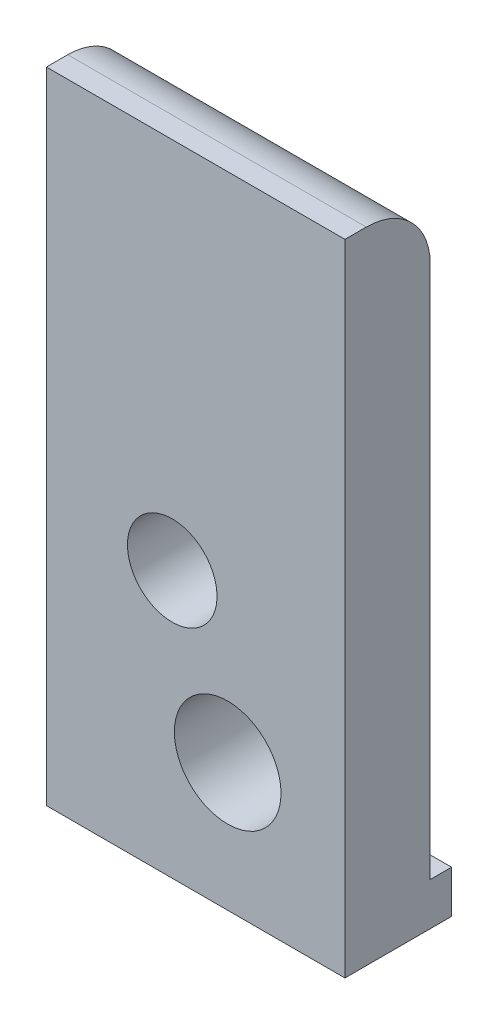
ISO-10303-21;
HEADER;
FILE_DESCRIPTION(('STEP AP214'),'2;1');
FILE_NAME('part.step','',(''),(''),'','','');
FILE_SCHEMA(('AUTOMOTIVE_DESIGN { 1 0 10303 214 1 1 1 1 }'));
ENDSEC;
DATA;
#1=APPLICATION_CONTEXT('core data for automotive mechanical design processes');
#2=APPLICATION_PROTOCOL_DEFINITION('international standard','automotive_design',2000,#1);
#3=PRODUCT_CONTEXT('',#1,'mechanical');
#4=PRODUCT('Part','Part','',(#3));
#5=PRODUCT_RELATED_PRODUCT_CATEGORY('part','',(#4));
#6=PRODUCT_DEFINITION_FORMATION('','',#4);
#7=PRODUCT_DEFINITION_CONTEXT('part definition',#1,'design');
#8=PRODUCT_DEFINITION('design','',#6,#7);
#9=PRODUCT_DEFINITION_SHAPE('','',#8);
#10=(LENGTH_UNIT() NAMED_UNIT(*) SI_UNIT(.MILLI.,.METRE.));
#11=(NAMED_UNIT(*) PLANE_ANGLE_UNIT() SI_UNIT($,.RADIAN.));
#12=(NAMED_UNIT(*) SI_UNIT($,.STERADIAN.) SOLID_ANGLE_UNIT());
#13=UNCERTAINTY_MEASURE_WITH_UNIT(LENGTH_MEASURE(1.E-05),#10,'distance_accuracy_value','');
#14=(GEOMETRIC_REPRESENTATION_CONTEXT(3) GLOBAL_UNCERTAINTY_ASSIGNED_CONTEXT((#13)) GLOBAL_UNIT_ASSIGNED_CONTEXT((#10,
#11,#12)) REPRESENTATION_CONTEXT('',''));
#15=CARTESIAN_POINT('',(0.,0.,0.));
#16=DIRECTION('',(0.,0.,1.));
#17=DIRECTION('',(1.,0.,0.));
#18=AXIS2_PLACEMENT_3D('',#15,#16,#17);
#19=CARTESIAN_POINT('',(0.,30.,0.));
#20=DIRECTION('',(0.,0.,1.));
#21=DIRECTION('',(1.,0.,0.));
#22=AXIS2_PLACEMENT_3D('',#19,#20,#21);
#23=PLANE('',#22);
#24=DIRECTION('',(0.,1.,0.));
#25=VECTOR('',#24,1.);
#26=CARTESIAN_POINT('',(4.1,9.99999999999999,0.));
#27=LINE('',#26,#25);
#28=CARTESIAN_POINT('',(4.1,13.5816653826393,0.));
#29=VERTEX_POINT('',#28);
#30=CARTESIAN_POINT('',(4.1,27.,0.));
#31=VERTEX_POINT('',#30);
#32=EDGE_CURVE('E426',#29,#31,#27,.T.);
#33=ORIENTED_EDGE('',*,*,#32,.F.);
#34=CARTESIAN_POINT('',(5.89999999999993,12.5,0.));
#35=DIRECTION('',(0.,0.,-1.));
#36=DIRECTION('',(-1.,0.,0.));
#37=AXIS2_PLACEMENT_3D('',#34,#35,#36);
#38=CIRCLE('',#37,2.1);
#39=CARTESIAN_POINT('',(3.9,13.1403124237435,0.));
#40=VERTEX_POINT('',#39);
#41=EDGE_CURVE('E416',#40,#29,#38,.T.);
#42=ORIENTED_EDGE('',*,*,#41,.F.);
#43=DIRECTION('',(0.,1.,0.));
#44=VECTOR('',#43,1.);
#45=CARTESIAN_POINT('',(3.9,10.,0.));
#46=LINE('',#45,#44);
#47=CARTESIAN_POINT('',(3.9,27.,0.));
#48=VERTEX_POINT('',#47);
#49=EDGE_CURVE('E424',#40,#48,#46,.T.);
#50=ORIENTED_EDGE('',*,*,#49,.T.);
#51=DIRECTION('',(-1.,0.,0.));
#52=VECTOR('',#51,1.);
#53=CARTESIAN_POINT('',(0.,27.,0.));
#54=LINE('',#53,#52);
#55=EDGE_CURVE('E816',#48,#31,#54,.F.);
#56=ORIENTED_EDGE('',*,*,#55,.T.);
#57=EDGE_LOOP('',(#33,#42,#50,#56));
#58=FACE_BOUND('',#57,.T.);
#59=ADVANCED_FACE('F27',(#58),#23,.F.);
#60=DIRECTION('',(0.,1.,0.));
#61=VECTOR('',#60,1.);
#62=CARTESIAN_POINT('',(5.1,10.,0.));
#63=LINE('',#62,#61);
#64=CARTESIAN_POINT('',(5.1,14.4416487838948,0.));
#65=VERTEX_POINT('',#64);
#66=CARTESIAN_POINT('',(5.1,27.,0.));
#67=VERTEX_POINT('',#66);
#68=EDGE_CURVE('E479',#65,#67,#63,.T.);
#69=ORIENTED_EDGE('',*,*,#68,.F.);
#70=CARTESIAN_POINT('',(4.9,14.346618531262,0.));
#71=VERTEX_POINT('',#70);
#72=EDGE_CURVE('E428',#71,#65,#38,.T.);
#73=ORIENTED_EDGE('',*,*,#72,.F.);
#74=DIRECTION('',(0.,1.,0.));
#75=VECTOR('',#74,1.);
#76=CARTESIAN_POINT('',(4.9,10.,0.));
#77=LINE('',#76,#75);
#78=CARTESIAN_POINT('',(4.9,27.,0.));
#79=VERTEX_POINT('',#78);
#80=EDGE_CURVE('E456',#71,#79,#77,.T.);
#81=ORIENTED_EDGE('',*,*,#80,.T.);
#82=EDGE_CURVE('E817',#79,#67,#54,.F.);
#83=ORIENTED_EDGE('',*,*,#82,.T.);
#84=EDGE_LOOP('',(#69,#73,#81,#83));
#85=FACE_BOUND('',#84,.T.);
#86=ADVANCED_FACE('F945',(#85),#23,.F.);
#87=DIRECTION('',(0.,1.,0.));
#88=VECTOR('',#87,1.);
#89=CARTESIAN_POINT('',(6.1,9.99999999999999,0.));
#90=LINE('',#89,#88);
#91=CARTESIAN_POINT('',(6.1,14.5904544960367,0.));
#92=VERTEX_POINT('',#91);
#93=CARTESIAN_POINT('',(6.1,27.,0.));
#94=VERTEX_POINT('',#93);
#95=EDGE_CURVE('E499',#92,#94,#90,.T.);
#96=ORIENTED_EDGE('',*,*,#95,.F.);
#97=CARTESIAN_POINT('',(5.9,14.6,0.));
#98=VERTEX_POINT('',#97);
#99=EDGE_CURVE('E947',#98,#92,#38,.T.);
#100=ORIENTED_EDGE('',*,*,#99,.F.);
#101=DIRECTION('',(0.,1.,0.));
#102=VECTOR('',#101,1.);
#103=CARTESIAN_POINT('',(5.9,10.,0.));
#104=LINE('',#103,#102);
#105=CARTESIAN_POINT('',(5.9,27.,0.));
#106=VERTEX_POINT('',#105);
#107=EDGE_CURVE('E475',#98,#106,#104,.T.);
#108=ORIENTED_EDGE('',*,*,#107,.T.);
#109=EDGE_CURVE('E819',#106,#94,#54,.F.);
#110=ORIENTED_EDGE('',*,*,#109,.T.);
#111=EDGE_LOOP('',(#96,#100,#108,#110));
#112=FACE_BOUND('',#111,.T.);
#113=ADVANCED_FACE('F960',(#112),#23,.F.);
#114=DIRECTION('',(0.,1.,0.));
#115=VECTOR('',#114,1.);
#116=CARTESIAN_POINT('',(7.1,10.,0.));
#117=LINE('',#116,#115);
#118=CARTESIAN_POINT('',(7.1,14.2233687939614,0.));
#119=VERTEX_POINT('',#118);
#120=CARTESIAN_POINT('',(7.1,27.,0.));
#121=VERTEX_POINT('',#120);
#122=EDGE_CURVE('E519',#119,#121,#117,.T.);
#123=ORIENTED_EDGE('',*,*,#122,.F.);
#124=CARTESIAN_POINT('',(6.9,14.3466185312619,0.));
#125=VERTEX_POINT('',#124);
#126=EDGE_CURVE('E961',#125,#119,#38,.T.);
#127=ORIENTED_EDGE('',*,*,#126,.F.);
#128=DIRECTION('',(0.,1.,0.));
#129=VECTOR('',#128,1.);
#130=CARTESIAN_POINT('',(6.9,9.99999999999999,0.));
#131=LINE('',#130,#129);
#132=CARTESIAN_POINT('',(6.9,27.,0.));
#133=VERTEX_POINT('',#132);
#134=EDGE_CURVE('E495',#125,#133,#131,.T.);
#135=ORIENTED_EDGE('',*,*,#134,.T.);
#136=EDGE_CURVE('E824',#133,#121,#54,.F.);
#137=ORIENTED_EDGE('',*,*,#136,.T.);
#138=EDGE_LOOP('',(#123,#127,#135,#137));
#139=FACE_BOUND('',#138,.T.);
#140=ADVANCED_FACE('F973',(#139),#23,.F.);
#141=CARTESIAN_POINT('',(7.9,10.,0.));
#142=DIRECTION('',(-0.707106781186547,0.,-0.707106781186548));
#143=DIRECTION('',(-0.707106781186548,0.,0.707106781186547));
#144=AXIS2_PLACEMENT_3D('',#141,#142,#143);
#145=PLANE('',#144);
#146=CARTESIAN_POINT('',(5.89999999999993,12.5,2.00000000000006));
#147=DIRECTION('',(-0.707106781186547,0.,-0.707106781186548));
#148=DIRECTION('',(0.707106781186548,0.,-0.707106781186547));
#149=AXIS2_PLACEMENT_3D('',#146,#147,#148);
#150=ELLIPSE('',#149,2.9698484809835,2.1);
#151=CARTESIAN_POINT('',(7.9,11.8596875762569,0.));
#152=VERTEX_POINT('',#151);
#153=CARTESIAN_POINT('',(7.5,11.1398529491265,0.4));
#154=VERTEX_POINT('',#153);
#155=EDGE_CURVE('E917',#152,#154,#150,.T.);
#156=ORIENTED_EDGE('',*,*,#155,.F.);
#157=DIRECTION('',(0.,1.,0.));
#158=VECTOR('',#157,1.);
#159=CARTESIAN_POINT('',(7.9,10.,0.));
#160=LINE('',#159,#158);
#161=CARTESIAN_POINT('',(7.9,10.,0.));
#162=VERTEX_POINT('',#161);
#163=EDGE_CURVE('E516',#162,#152,#160,.T.);
#164=ORIENTED_EDGE('',*,*,#163,.F.);
#165=DIRECTION('',(-0.707106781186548,0.,0.707106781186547));
#166=VECTOR('',#165,1.);
#167=CARTESIAN_POINT('',(7.9,10.,0.));
#168=LINE('',#167,#166);
#169=CARTESIAN_POINT('',(7.5,10.,0.4));
#170=VERTEX_POINT('',#169);
#171=EDGE_CURVE('E507',#162,#170,#168,.T.);
#172=ORIENTED_EDGE('',*,*,#171,.T.);
#173=DIRECTION('',(0.,1.,0.));
#174=VECTOR('',#173,1.);
#175=CARTESIAN_POINT('',(7.5,10.,0.4));
#176=LINE('',#175,#174);
#177=EDGE_CURVE('E524',#170,#154,#176,.T.);
#178=ORIENTED_EDGE('',*,*,#177,.T.);
#179=EDGE_LOOP('',(#156,#164,#172,#178));
#180=FACE_BOUND('',#179,.T.);
#181=ADVANCED_FACE('F1073',(#180),#145,.T.);
#182=CARTESIAN_POINT('',(7.5,10.,0.4));
#183=DIRECTION('',(0.707106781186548,0.,-0.707106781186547));
#184=DIRECTION('',(-0.707106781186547,0.,-0.707106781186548));
#185=AXIS2_PLACEMENT_3D('',#182,#183,#184);
#186=PLANE('',#185);
#187=CARTESIAN_POINT('',(5.89999999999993,12.5,-1.20000000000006));
#188=DIRECTION('',(0.707106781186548,0.,-0.707106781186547));
#189=DIRECTION('',(-0.707106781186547,0.,-0.707106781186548));
#190=AXIS2_PLACEMENT_3D('',#187,#188,#189);
#191=ELLIPSE('',#190,2.9698484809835,2.1);
#192=CARTESIAN_POINT('',(7.5,13.8601470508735,0.4));
#193=VERTEX_POINT('',#192);
#194=EDGE_CURVE('E919',#119,#193,#191,.T.);
#195=ORIENTED_EDGE('',*,*,#194,.F.);
#196=ORIENTED_EDGE('',*,*,#122,.T.);
#197=CARTESIAN_POINT('',(10.1,27.,3.));
#198=DIRECTION('',(0.707106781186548,0.,-0.707106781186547));
#199=DIRECTION('',(-0.707106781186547,0.,-0.707106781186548));
#200=AXIS2_PLACEMENT_3D('',#197,#198,#199);
#201=ELLIPSE('',#200,4.24264068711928,3.);
#202=CARTESIAN_POINT('',(7.5,28.4966629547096,0.4));
#203=VERTEX_POINT('',#202);
#204=EDGE_CURVE('E699',#203,#121,#201,.F.);
#205=ORIENTED_EDGE('',*,*,#204,.F.);
#206=EDGE_CURVE('E523',#193,#203,#176,.T.);
#207=ORIENTED_EDGE('',*,*,#206,.F.);
#208=EDGE_LOOP('',(#195,#196,#205,#207));
#209=FACE_BOUND('',#208,.T.);
#210=ADVANCED_FACE('F980',(#209),#186,.T.);
#211=CARTESIAN_POINT('',(6.9,9.99999999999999,0.));
#212=DIRECTION('',(-0.707106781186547,0.,-0.707106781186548));
#213=DIRECTION('',(-0.707106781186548,0.,0.707106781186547));
#214=AXIS2_PLACEMENT_3D('',#211,#212,#213);
#215=PLANE('',#214);
#216=CARTESIAN_POINT('',(5.89999999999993,12.5,1.00000000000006));
#217=DIRECTION('',(-0.707106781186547,0.,-0.707106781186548));
#218=DIRECTION('',(0.707106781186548,0.,-0.707106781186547));
#219=AXIS2_PLACEMENT_3D('',#216,#217,#218);
#220=ELLIPSE('',#219,2.9698484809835,2.1);
#221=CARTESIAN_POINT('',(6.9,10.6533814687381,0.));
#222=VERTEX_POINT('',#221);
#223=CARTESIAN_POINT('',(6.5,10.4875388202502,0.4));
#224=VERTEX_POINT('',#223);
#225=EDGE_CURVE('E923',#222,#224,#220,.T.);
#226=ORIENTED_EDGE('',*,*,#225,.F.);
#227=CARTESIAN_POINT('',(6.9,9.99999999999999,0.));
#228=VERTEX_POINT('',#227);
#229=EDGE_CURVE('E496',#228,#222,#131,.T.);
#230=ORIENTED_EDGE('',*,*,#229,.F.);
#231=DIRECTION('',(-0.707106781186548,0.,0.707106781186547));
#232=VECTOR('',#231,1.);
#233=CARTESIAN_POINT('',(6.9,9.99999999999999,0.));
#234=LINE('',#233,#232);
#235=CARTESIAN_POINT('',(6.5,10.,0.4));
#236=VERTEX_POINT('',#235);
#237=EDGE_CURVE('E487',#228,#236,#234,.T.);
#238=ORIENTED_EDGE('',*,*,#237,.T.);
#239=DIRECTION('',(0.,1.,0.));
#240=VECTOR('',#239,1.);
#241=CARTESIAN_POINT('',(6.5,10.,0.4));
#242=LINE('',#241,#240);
#243=EDGE_CURVE('E504',#236,#224,#242,.T.);
#244=ORIENTED_EDGE('',*,*,#243,.T.);
#245=EDGE_LOOP('',(#226,#230,#238,#244));
#246=FACE_BOUND('',#245,.T.);
#247=ADVANCED_FACE('F1268',(#246),#215,.T.);
#248=CARTESIAN_POINT('',(6.5,10.,0.4));
#249=DIRECTION('',(0.707106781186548,0.,-0.707106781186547));
#250=DIRECTION('',(-0.707106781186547,0.,-0.707106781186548));
#251=AXIS2_PLACEMENT_3D('',#248,#249,#250);
#252=PLANE('',#251);
#253=CARTESIAN_POINT('',(5.89999999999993,12.5,-0.200000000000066));
#254=DIRECTION('',(0.707106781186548,0.,-0.707106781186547));
#255=DIRECTION('',(-0.707106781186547,0.,-0.707106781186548));
#256=AXIS2_PLACEMENT_3D('',#253,#254,#255);
#257=ELLIPSE('',#256,2.9698484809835,2.1);
#258=CARTESIAN_POINT('',(6.5,14.5124611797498,0.4));
#259=VERTEX_POINT('',#258);
#260=EDGE_CURVE('E925',#92,#259,#257,.T.);
#261=ORIENTED_EDGE('',*,*,#260,.F.);
#262=ORIENTED_EDGE('',*,*,#95,.T.);
#263=CARTESIAN_POINT('',(9.1,27.,3.));
#264=DIRECTION('',(0.707106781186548,0.,-0.707106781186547));
#265=DIRECTION('',(-0.707106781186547,0.,-0.707106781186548));
#266=AXIS2_PLACEMENT_3D('',#263,#264,#265);
#267=ELLIPSE('',#266,4.24264068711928,3.);
#268=CARTESIAN_POINT('',(6.5,28.4966629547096,0.4));
#269=VERTEX_POINT('',#268);
#270=EDGE_CURVE('E705',#269,#94,#267,.F.);
#271=ORIENTED_EDGE('',*,*,#270,.F.);
#272=EDGE_CURVE('E503',#259,#269,#242,.T.);
#273=ORIENTED_EDGE('',*,*,#272,.F.);
#274=EDGE_LOOP('',(#261,#262,#271,#273));
#275=FACE_BOUND('',#274,.T.);
#276=ADVANCED_FACE('F967',(#275),#252,.T.);
#277=CARTESIAN_POINT('',(5.9,10.,0.));
#278=DIRECTION('',(-0.707106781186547,0.,-0.707106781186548));
#279=DIRECTION('',(-0.707106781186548,0.,0.707106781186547));
#280=AXIS2_PLACEMENT_3D('',#277,#278,#279);
#281=PLANE('',#280);
#282=CARTESIAN_POINT('',(5.89999999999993,12.5,0.));
#283=DIRECTION('',(-0.707106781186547,0.,-0.707106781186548));
#284=DIRECTION('',(0.707106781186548,0.,-0.707106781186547));
#285=AXIS2_PLACEMENT_3D('',#282,#283,#284);
#286=ELLIPSE('',#285,2.9698484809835,2.1);
#287=CARTESIAN_POINT('',(5.9,10.4,0.));
#288=VERTEX_POINT('',#287);
#289=CARTESIAN_POINT('',(5.5,10.4384471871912,0.4));
#290=VERTEX_POINT('',#289);
#291=EDGE_CURVE('E929',#288,#290,#286,.T.);
#292=ORIENTED_EDGE('',*,*,#291,.F.);
#293=CARTESIAN_POINT('',(5.9,10.,0.));
#294=VERTEX_POINT('',#293);
#295=EDGE_CURVE('E476',#294,#288,#104,.T.);
#296=ORIENTED_EDGE('',*,*,#295,.F.);
#297=DIRECTION('',(-0.707106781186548,0.,0.707106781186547));
#298=VECTOR('',#297,1.);
#299=CARTESIAN_POINT('',(5.9,10.,0.));
#300=LINE('',#299,#298);
#301=CARTESIAN_POINT('',(5.5,10.,0.4));
#302=VERTEX_POINT('',#301);
#303=EDGE_CURVE('E467',#294,#302,#300,.T.);
#304=ORIENTED_EDGE('',*,*,#303,.T.);
#305=DIRECTION('',(0.,1.,0.));
#306=VECTOR('',#305,1.);
#307=CARTESIAN_POINT('',(5.5,10.,0.4));
#308=LINE('',#307,#306);
#309=EDGE_CURVE('E484',#302,#290,#308,.T.);
#310=ORIENTED_EDGE('',*,*,#309,.T.);
#311=EDGE_LOOP('',(#292,#296,#304,#310));
#312=FACE_BOUND('',#311,.T.);
#313=ADVANCED_FACE('F1245',(#312),#281,.T.);
#314=CARTESIAN_POINT('',(5.5,10.,0.4));
#315=DIRECTION('',(0.707106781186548,0.,-0.707106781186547));
#316=DIRECTION('',(-0.707106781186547,0.,-0.707106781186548));
#317=AXIS2_PLACEMENT_3D('',#314,#315,#316);
#318=PLANE('',#317);
#319=CARTESIAN_POINT('',(5.89999999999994,12.5,0.799999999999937));
#320=DIRECTION('',(0.707106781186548,0.,-0.707106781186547));
#321=DIRECTION('',(-0.707106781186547,0.,-0.707106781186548));
#322=AXIS2_PLACEMENT_3D('',#319,#320,#321);
#323=ELLIPSE('',#322,2.9698484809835,2.1);
#324=CARTESIAN_POINT('',(5.5,14.5615528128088,0.4));
#325=VERTEX_POINT('',#324);
#326=EDGE_CURVE('E931',#65,#325,#323,.T.);
#327=ORIENTED_EDGE('',*,*,#326,.F.);
#328=ORIENTED_EDGE('',*,*,#68,.T.);
#329=CARTESIAN_POINT('',(8.09999999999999,27.,3.));
#330=DIRECTION('',(0.707106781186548,0.,-0.707106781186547));
#331=DIRECTION('',(-0.707106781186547,0.,-0.707106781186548));
#332=AXIS2_PLACEMENT_3D('',#329,#330,#331);
#333=ELLIPSE('',#332,4.24264068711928,3.);
#334=CARTESIAN_POINT('',(5.5,28.4966629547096,0.4));
#335=VERTEX_POINT('',#334);
#336=EDGE_CURVE('E711',#335,#67,#333,.F.);
#337=ORIENTED_EDGE('',*,*,#336,.F.);
#338=EDGE_CURVE('E483',#325,#335,#308,.T.);
#339=ORIENTED_EDGE('',*,*,#338,.F.);
#340=EDGE_LOOP('',(#327,#328,#337,#339));
#341=FACE_BOUND('',#340,.T.);
#342=ADVANCED_FACE('F954',(#341),#318,.T.);
#343=CARTESIAN_POINT('',(4.9,10.,0.));
#344=DIRECTION('',(-0.707106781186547,0.,-0.707106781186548));
#345=DIRECTION('',(-0.707106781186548,0.,0.707106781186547));
#346=AXIS2_PLACEMENT_3D('',#343,#344,#345);
#347=PLANE('',#346);
#348=CARTESIAN_POINT('',(5.89999999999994,12.5,-0.999999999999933));
#349=DIRECTION('',(-0.707106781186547,0.,-0.707106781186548));
#350=DIRECTION('',(0.707106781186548,0.,-0.707106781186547));
#351=AXIS2_PLACEMENT_3D('',#348,#349,#350);
#352=ELLIPSE('',#351,2.9698484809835,2.1);
#353=CARTESIAN_POINT('',(4.9,10.653381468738,0.));
#354=VERTEX_POINT('',#353);
#355=CARTESIAN_POINT('',(4.5,10.9347524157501,0.4));
#356=VERTEX_POINT('',#355);
#357=EDGE_CURVE('E935',#354,#356,#352,.T.);
#358=ORIENTED_EDGE('',*,*,#357,.F.);
#359=CARTESIAN_POINT('',(4.9,10.,0.));
#360=VERTEX_POINT('',#359);
#361=EDGE_CURVE('E457',#360,#354,#77,.T.);
#362=ORIENTED_EDGE('',*,*,#361,.F.);
#363=DIRECTION('',(-0.707106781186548,0.,0.707106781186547));
#364=VECTOR('',#363,1.);
#365=CARTESIAN_POINT('',(4.9,10.,0.));
#366=LINE('',#365,#364);
#367=CARTESIAN_POINT('',(4.5,9.99999999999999,0.4));
#368=VERTEX_POINT('',#367);
#369=EDGE_CURVE('E448',#360,#368,#366,.T.);
#370=ORIENTED_EDGE('',*,*,#369,.T.);
#371=DIRECTION('',(0.,1.,0.));
#372=VECTOR('',#371,1.);
#373=CARTESIAN_POINT('',(4.5,9.99999999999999,0.4));
#374=LINE('',#373,#372);
#375=EDGE_CURVE('E464',#368,#356,#374,.T.);
#376=ORIENTED_EDGE('',*,*,#375,.T.);
#377=EDGE_LOOP('',(#358,#362,#370,#376));
#378=FACE_BOUND('',#377,.T.);
#379=ADVANCED_FACE('F1067',(#378),#347,.T.);
#380=CARTESIAN_POINT('',(4.5,9.99999999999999,0.4));
#381=DIRECTION('',(0.707106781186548,0.,-0.707106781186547));
#382=DIRECTION('',(-0.707106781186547,0.,-0.707106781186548));
#383=AXIS2_PLACEMENT_3D('',#380,#381,#382);
#384=PLANE('',#383);
#385=CARTESIAN_POINT('',(5.89999999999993,12.5,1.79999999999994));
#386=DIRECTION('',(0.707106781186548,0.,-0.707106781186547));
#387=DIRECTION('',(-0.707106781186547,0.,-0.707106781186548));
#388=AXIS2_PLACEMENT_3D('',#385,#386,#387);
#389=ELLIPSE('',#388,2.9698484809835,2.1);
#390=CARTESIAN_POINT('',(4.5,14.0652475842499,0.4));
#391=VERTEX_POINT('',#390);
#392=EDGE_CURVE('E937',#29,#391,#389,.T.);
#393=ORIENTED_EDGE('',*,*,#392,.F.);
#394=ORIENTED_EDGE('',*,*,#32,.T.);
#395=CARTESIAN_POINT('',(7.09999999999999,27.,3.));
#396=DIRECTION('',(0.707106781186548,0.,-0.707106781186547));
#397=DIRECTION('',(-0.707106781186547,0.,-0.707106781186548));
#398=AXIS2_PLACEMENT_3D('',#395,#396,#397);
#399=ELLIPSE('',#398,4.24264068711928,3.);
#400=CARTESIAN_POINT('',(4.5,28.4966629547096,0.4));
#401=VERTEX_POINT('',#400);
#402=EDGE_CURVE('E717',#401,#31,#399,.F.);
#403=ORIENTED_EDGE('',*,*,#402,.F.);
#404=EDGE_CURVE('E463',#391,#401,#374,.T.);
#405=ORIENTED_EDGE('',*,*,#404,.F.);
#406=EDGE_LOOP('',(#393,#394,#403,#405));
#407=FACE_BOUND('',#406,.T.);
#408=ADVANCED_FACE('F1060',(#407),#384,.T.);
#409=CARTESIAN_POINT('',(8.5,6.00000000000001,0.));
#410=DIRECTION('',(0.,0.,-1.));
#411=DIRECTION('',(-1.,0.,0.));
#412=AXIS2_PLACEMENT_3D('',#409,#410,#411);
#413=CIRCLE('',#412,2.5);
#414=CARTESIAN_POINT('',(6.,6.00000000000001,0.));
#415=VERTEX_POINT('',#414);
#416=EDGE_CURVE('E906',#415,#415,#413,.T.);
#417=ORIENTED_EDGE('',*,*,#416,.F.);
#418=EDGE_LOOP('',(#417));
#419=FACE_BOUND('',#418,.T.);
#420=CARTESIAN_POINT('',(3.9,10.,0.));
#421=VERTEX_POINT('',#420);
#422=CARTESIAN_POINT('',(3.9,11.8596875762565,0.));
#423=VERTEX_POINT('',#422);
#424=EDGE_CURVE('E435',#421,#423,#46,.T.);
#425=ORIENTED_EDGE('',*,*,#424,.T.);
#426=CARTESIAN_POINT('',(4.1,11.4183346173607,0.));
#427=VERTEX_POINT('',#426);
#428=EDGE_CURVE('E41',#427,#423,#38,.T.);
#429=ORIENTED_EDGE('',*,*,#428,.F.);
#430=CARTESIAN_POINT('',(4.1,9.99999999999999,0.));
#431=VERTEX_POINT('',#430);
#432=EDGE_CURVE('E460',#431,#427,#27,.T.);
#433=ORIENTED_EDGE('',*,*,#432,.F.);
#434=DIRECTION('',(-1.,0.,0.));
#435=VECTOR('',#434,1.);
#436=CARTESIAN_POINT('',(4.9,10.,0.));
#437=LINE('',#436,#435);
#438=EDGE_CURVE('E453',#360,#431,#437,.T.);
#439=ORIENTED_EDGE('',*,*,#438,.F.);
#440=ORIENTED_EDGE('',*,*,#361,.T.);
#441=CARTESIAN_POINT('',(5.1,10.5583512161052,0.));
#442=VERTEX_POINT('',#441);
#443=EDGE_CURVE('E1456',#442,#354,#38,.T.);
#444=ORIENTED_EDGE('',*,*,#443,.F.);
#445=CARTESIAN_POINT('',(5.1,10.,0.));
#446=VERTEX_POINT('',#445);
#447=EDGE_CURVE('E480',#446,#442,#63,.T.);
#448=ORIENTED_EDGE('',*,*,#447,.F.);
#449=DIRECTION('',(-1.,0.,0.));
#450=VECTOR('',#449,1.);
#451=CARTESIAN_POINT('',(5.9,10.,0.));
#452=LINE('',#451,#450);
#453=EDGE_CURVE('E472',#294,#446,#452,.T.);
#454=ORIENTED_EDGE('',*,*,#453,.F.);
#455=ORIENTED_EDGE('',*,*,#295,.T.);
#456=CARTESIAN_POINT('',(6.1,10.4095455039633,0.));
#457=VERTEX_POINT('',#456);
#458=EDGE_CURVE('E1453',#457,#288,#38,.T.);
#459=ORIENTED_EDGE('',*,*,#458,.F.);
#460=CARTESIAN_POINT('',(6.1,9.99999999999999,0.));
#461=VERTEX_POINT('',#460);
#462=EDGE_CURVE('E500',#461,#457,#90,.T.);
#463=ORIENTED_EDGE('',*,*,#462,.F.);
#464=DIRECTION('',(-1.,0.,0.));
#465=VECTOR('',#464,1.);
#466=CARTESIAN_POINT('',(6.9,9.99999999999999,0.));
#467=LINE('',#466,#465);
#468=EDGE_CURVE('E492',#228,#461,#467,.T.);
#469=ORIENTED_EDGE('',*,*,#468,.F.);
#470=ORIENTED_EDGE('',*,*,#229,.T.);
#471=CARTESIAN_POINT('',(7.1,10.7766312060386,0.));
#472=VERTEX_POINT('',#471);
#473=EDGE_CURVE('E987',#472,#222,#38,.T.);
#474=ORIENTED_EDGE('',*,*,#473,.F.);
#475=CARTESIAN_POINT('',(7.1,10.,0.));
#476=VERTEX_POINT('',#475);
#477=EDGE_CURVE('E520',#476,#472,#117,.T.);
#478=ORIENTED_EDGE('',*,*,#477,.F.);
#479=DIRECTION('',(-1.,0.,0.));
#480=VECTOR('',#479,1.);
#481=CARTESIAN_POINT('',(7.9,10.,0.));
#482=LINE('',#481,#480);
#483=EDGE_CURVE('E512',#162,#476,#482,.T.);
#484=ORIENTED_EDGE('',*,*,#483,.F.);
#485=ORIENTED_EDGE('',*,*,#163,.T.);
#486=CARTESIAN_POINT('',(7.9,13.1403124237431,0.));
#487=VERTEX_POINT('',#486);
#488=EDGE_CURVE('E974',#487,#152,#38,.T.);
#489=ORIENTED_EDGE('',*,*,#488,.F.);
#490=CARTESIAN_POINT('',(7.9,27.,0.));
#491=VERTEX_POINT('',#490);
#492=EDGE_CURVE('E515',#487,#491,#160,.T.);
#493=ORIENTED_EDGE('',*,*,#492,.T.);
#494=CARTESIAN_POINT('',(8.1,27.,0.));
#495=VERTEX_POINT('',#494);
#496=EDGE_CURVE('E829',#491,#495,#54,.F.);
#497=ORIENTED_EDGE('',*,*,#496,.T.);
#498=DIRECTION('',(0.,1.,0.));
#499=VECTOR('',#498,1.);
#500=CARTESIAN_POINT('',(8.1,10.,0.));
#501=LINE('',#500,#499);
#502=CARTESIAN_POINT('',(8.1,10.,0.));
#503=VERTEX_POINT('',#502);
#504=EDGE_CURVE('E538',#503,#495,#501,.T.);
#505=ORIENTED_EDGE('',*,*,#504,.F.);
#506=DIRECTION('',(-1.,0.,0.));
#507=VECTOR('',#506,1.);
#508=CARTESIAN_POINT('',(8.9,9.99999999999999,0.));
#509=LINE('',#508,#507);
#510=CARTESIAN_POINT('',(8.9,9.99999999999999,0.));
#511=VERTEX_POINT('',#510);
#512=EDGE_CURVE('E532',#511,#503,#509,.T.);
#513=ORIENTED_EDGE('',*,*,#512,.F.);
#514=DIRECTION('',(0.,1.,0.));
#515=VECTOR('',#514,1.);
#516=CARTESIAN_POINT('',(8.9,9.99999999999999,0.));
#517=LINE('',#516,#515);
#518=CARTESIAN_POINT('',(8.9,27.,0.));
#519=VERTEX_POINT('',#518);
#520=EDGE_CURVE('E535',#511,#519,#517,.T.);
#521=ORIENTED_EDGE('',*,*,#520,.T.);
#522=CARTESIAN_POINT('',(9.1,27.,0.));
#523=VERTEX_POINT('',#522);
#524=EDGE_CURVE('E833',#519,#523,#54,.F.);
#525=ORIENTED_EDGE('',*,*,#524,.T.);
#526=DIRECTION('',(0.,1.,0.));
#527=VECTOR('',#526,1.);
#528=CARTESIAN_POINT('',(9.1,10.,0.));
#529=LINE('',#528,#527);
#530=CARTESIAN_POINT('',(9.1,10.,0.));
#531=VERTEX_POINT('',#530);
#532=EDGE_CURVE('E555',#531,#523,#529,.T.);
#533=ORIENTED_EDGE('',*,*,#532,.F.);
#534=DIRECTION('',(-1.,0.,0.));
#535=VECTOR('',#534,1.);
#536=CARTESIAN_POINT('',(9.9,10.,0.));
#537=LINE('',#536,#535);
#538=CARTESIAN_POINT('',(9.9,10.,0.));
#539=VERTEX_POINT('',#538);
#540=EDGE_CURVE('E549',#539,#531,#537,.T.);
#541=ORIENTED_EDGE('',*,*,#540,.F.);
#542=DIRECTION('',(0.,1.,0.));
#543=VECTOR('',#542,1.);
#544=CARTESIAN_POINT('',(9.9,10.,0.));
#545=LINE('',#544,#543);
#546=CARTESIAN_POINT('',(9.9,27.,0.));
#547=VERTEX_POINT('',#546);
#548=EDGE_CURVE('E552',#539,#547,#545,.T.);
#549=ORIENTED_EDGE('',*,*,#548,.T.);
#550=CARTESIAN_POINT('',(10.1,27.,0.));
#551=VERTEX_POINT('',#550);
#552=EDGE_CURVE('E836',#547,#551,#54,.F.);
#553=ORIENTED_EDGE('',*,*,#552,.T.);
#554=DIRECTION('',(0.,1.,0.));
#555=VECTOR('',#554,1.);
#556=CARTESIAN_POINT('',(10.1,10.,0.));
#557=LINE('',#556,#555);
#558=CARTESIAN_POINT('',(10.1,10.,0.));
#559=VERTEX_POINT('',#558);
#560=EDGE_CURVE('E572',#559,#551,#557,.T.);
#561=ORIENTED_EDGE('',*,*,#560,.F.);
#562=DIRECTION('',(-1.,0.,0.));
#563=VECTOR('',#562,1.);
#564=CARTESIAN_POINT('',(10.9,10.,0.));
#565=LINE('',#564,#563);
#566=CARTESIAN_POINT('',(10.9,10.,0.));
#567=VERTEX_POINT('',#566);
#568=EDGE_CURVE('E566',#567,#559,#565,.T.);
#569=ORIENTED_EDGE('',*,*,#568,.F.);
#570=DIRECTION('',(0.,1.,0.));
#571=VECTOR('',#570,1.);
#572=CARTESIAN_POINT('',(10.9,10.,0.));
#573=LINE('',#572,#571);
#574=CARTESIAN_POINT('',(10.9,27.,0.));
#575=VERTEX_POINT('',#574);
#576=EDGE_CURVE('E569',#567,#575,#573,.T.);
#577=ORIENTED_EDGE('',*,*,#576,.T.);
#578=CARTESIAN_POINT('',(11.1,27.,0.));
#579=VERTEX_POINT('',#578);
#580=EDGE_CURVE('E839',#575,#579,#54,.F.);
#581=ORIENTED_EDGE('',*,*,#580,.T.);
#582=DIRECTION('',(0.,1.,0.));
#583=VECTOR('',#582,1.);
#584=CARTESIAN_POINT('',(11.1,9.99999999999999,0.));
#585=LINE('',#584,#583);
#586=CARTESIAN_POINT('',(11.1,9.99999999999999,0.));
#587=VERTEX_POINT('',#586);
#588=EDGE_CURVE('E589',#587,#579,#585,.T.);
#589=ORIENTED_EDGE('',*,*,#588,.F.);
#590=DIRECTION('',(-1.,0.,0.));
#591=VECTOR('',#590,1.);
#592=CARTESIAN_POINT('',(11.9,10.,0.));
#593=LINE('',#592,#591);
#594=CARTESIAN_POINT('',(11.9,10.,0.));
#595=VERTEX_POINT('',#594);
#596=EDGE_CURVE('E583',#595,#587,#593,.T.);
#597=ORIENTED_EDGE('',*,*,#596,.F.);
#598=DIRECTION('',(0.,1.,0.));
#599=VECTOR('',#598,1.);
#600=CARTESIAN_POINT('',(11.9,10.,0.));
#601=LINE('',#600,#599);
#602=CARTESIAN_POINT('',(11.9,27.,0.));
#603=VERTEX_POINT('',#602);
#604=EDGE_CURVE('E586',#595,#603,#601,.T.);
#605=ORIENTED_EDGE('',*,*,#604,.T.);
#606=CARTESIAN_POINT('',(12.1,27.,0.));
#607=VERTEX_POINT('',#606);
#608=EDGE_CURVE('E842',#603,#607,#54,.F.);
#609=ORIENTED_EDGE('',*,*,#608,.T.);
#610=DIRECTION('',(0.,1.,0.));
#611=VECTOR('',#610,1.);
#612=CARTESIAN_POINT('',(12.1,10.,0.));
#613=LINE('',#612,#611);
#614=CARTESIAN_POINT('',(12.1,10.,0.));
#615=VERTEX_POINT('',#614);
#616=EDGE_CURVE('E606',#615,#607,#613,.T.);
#617=ORIENTED_EDGE('',*,*,#616,.F.);
#618=DIRECTION('',(-1.,0.,0.));
#619=VECTOR('',#618,1.);
#620=CARTESIAN_POINT('',(12.9,10.,0.));
#621=LINE('',#620,#619);
#622=CARTESIAN_POINT('',(12.9,10.,0.));
#623=VERTEX_POINT('',#622);
#624=EDGE_CURVE('E600',#623,#615,#621,.T.);
#625=ORIENTED_EDGE('',*,*,#624,.F.);
#626=DIRECTION('',(0.,1.,0.));
#627=VECTOR('',#626,1.);
#628=CARTESIAN_POINT('',(12.9,10.,0.));
#629=LINE('',#628,#627);
#630=CARTESIAN_POINT('',(12.9,27.,0.));
#631=VERTEX_POINT('',#630);
#632=EDGE_CURVE('E603',#623,#631,#629,.T.);
#633=ORIENTED_EDGE('',*,*,#632,.T.);
#634=CARTESIAN_POINT('',(13.1,27.,0.));
#635=VERTEX_POINT('',#634);
#636=EDGE_CURVE('E845',#631,#635,#54,.F.);
#637=ORIENTED_EDGE('',*,*,#636,.T.);
#638=DIRECTION('',(0.,1.,0.));
#639=VECTOR('',#638,1.);
#640=CARTESIAN_POINT('',(13.1,9.99999999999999,0.));
#641=LINE('',#640,#639);
#642=CARTESIAN_POINT('',(13.1,9.99999999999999,0.));
#643=VERTEX_POINT('',#642);
#644=EDGE_CURVE('E623',#643,#635,#641,.T.);
#645=ORIENTED_EDGE('',*,*,#644,.F.);
#646=DIRECTION('',(-1.,0.,0.));
#647=VECTOR('',#646,1.);
#648=CARTESIAN_POINT('',(13.9,10.,0.));
#649=LINE('',#648,#647);
#650=CARTESIAN_POINT('',(13.9,10.,0.));
#651=VERTEX_POINT('',#650);
#652=EDGE_CURVE('E617',#651,#643,#649,.T.);
#653=ORIENTED_EDGE('',*,*,#652,.F.);
#654=DIRECTION('',(0.,1.,0.));
#655=VECTOR('',#654,1.);
#656=CARTESIAN_POINT('',(13.9,10.,0.));
#657=LINE('',#656,#655);
#658=CARTESIAN_POINT('',(13.9,27.,0.));
#659=VERTEX_POINT('',#658);
#660=EDGE_CURVE('E620',#651,#659,#657,.T.);
#661=ORIENTED_EDGE('',*,*,#660,.T.);
#662=CARTESIAN_POINT('',(14.,27.,0.));
#663=VERTEX_POINT('',#662);
#664=EDGE_CURVE('E656',#659,#663,#54,.F.);
#665=ORIENTED_EDGE('',*,*,#664,.T.);
#666=DIRECTION('',(0.,-1.,0.));
#667=VECTOR('',#666,1.);
#668=CARTESIAN_POINT('',(14.,30.,0.));
#669=LINE('',#668,#667);
#670=CARTESIAN_POINT('',(14.,2.,0.));
#671=VERTEX_POINT('',#670);
#672=EDGE_CURVE('E49',#663,#671,#669,.T.);
#673=ORIENTED_EDGE('',*,*,#672,.T.);
#674=DIRECTION('',(-1.,0.,0.));
#675=VECTOR('',#674,1.);
#676=CARTESIAN_POINT('',(0.,2.,0.));
#677=LINE('',#676,#675);
#678=CARTESIAN_POINT('',(0.,2.,0.));
#679=VERTEX_POINT('',#678);
#680=EDGE_CURVE('E877',#671,#679,#677,.T.);
#681=ORIENTED_EDGE('',*,*,#680,.T.);
#682=DIRECTION('',(0.,1.,0.));
#683=VECTOR('',#682,1.);
#684=CARTESIAN_POINT('',(0.,0.,0.));
#685=LINE('',#684,#683);
#686=CARTESIAN_POINT('',(0.,27.,0.));
#687=VERTEX_POINT('',#686);
#688=EDGE_CURVE('E634',#679,#687,#685,.T.);
#689=ORIENTED_EDGE('',*,*,#688,.T.);
#690=CARTESIAN_POINT('',(0.0999999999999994,27.,0.));
#691=VERTEX_POINT('',#690);
#692=EDGE_CURVE('E657',#687,#691,#54,.F.);
#693=ORIENTED_EDGE('',*,*,#692,.T.);
#694=DIRECTION('',(0.,1.,0.));
#695=VECTOR('',#694,1.);
#696=CARTESIAN_POINT('',(0.0999999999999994,10.,0.));
#697=LINE('',#696,#695);
#698=CARTESIAN_POINT('',(0.0999999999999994,10.,0.));
#699=VERTEX_POINT('',#698);
#700=EDGE_CURVE('E761',#699,#691,#697,.T.);
#701=ORIENTED_EDGE('',*,*,#700,.F.);
#702=DIRECTION('',(-1.,0.,0.));
#703=VECTOR('',#702,1.);
#704=CARTESIAN_POINT('',(0.899999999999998,10.,0.));
#705=LINE('',#704,#703);
#706=CARTESIAN_POINT('',(0.899999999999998,10.,0.));
#707=VERTEX_POINT('',#706);
#708=EDGE_CURVE('E760',#707,#699,#705,.T.);
#709=ORIENTED_EDGE('',*,*,#708,.F.);
#710=DIRECTION('',(0.,1.,0.));
#711=VECTOR('',#710,1.);
#712=CARTESIAN_POINT('',(0.899999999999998,10.,0.));
#713=LINE('',#712,#711);
#714=CARTESIAN_POINT('',(0.899999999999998,27.,0.));
#715=VERTEX_POINT('',#714);
#716=EDGE_CURVE('E751',#707,#715,#713,.T.);
#717=ORIENTED_EDGE('',*,*,#716,.T.);
#718=CARTESIAN_POINT('',(1.1,27.,0.));
#719=VERTEX_POINT('',#718);
#720=EDGE_CURVE('E661',#715,#719,#54,.F.);
#721=ORIENTED_EDGE('',*,*,#720,.T.);
#722=DIRECTION('',(0.,1.,0.));
#723=VECTOR('',#722,1.);
#724=CARTESIAN_POINT('',(1.1,10.,0.));
#725=LINE('',#724,#723);
#726=CARTESIAN_POINT('',(1.1,10.,0.));
#727=VERTEX_POINT('',#726);
#728=EDGE_CURVE('E780',#727,#719,#725,.T.);
#729=ORIENTED_EDGE('',*,*,#728,.F.);
#730=DIRECTION('',(-1.,0.,0.));
#731=VECTOR('',#730,1.);
#732=CARTESIAN_POINT('',(1.9,9.99999999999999,0.));
#733=LINE('',#732,#731);
#734=CARTESIAN_POINT('',(1.9,9.99999999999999,0.));
#735=VERTEX_POINT('',#734);
#736=EDGE_CURVE('E774',#735,#727,#733,.T.);
#737=ORIENTED_EDGE('',*,*,#736,.F.);
#738=DIRECTION('',(0.,1.,0.));
#739=VECTOR('',#738,1.);
#740=CARTESIAN_POINT('',(1.9,9.99999999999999,0.));
#741=LINE('',#740,#739);
#742=CARTESIAN_POINT('',(1.9,27.,0.));
#743=VERTEX_POINT('',#742);
#744=EDGE_CURVE('E777',#735,#743,#741,.T.);
#745=ORIENTED_EDGE('',*,*,#744,.T.);
#746=CARTESIAN_POINT('',(2.1,27.,0.));
#747=VERTEX_POINT('',#746);
#748=EDGE_CURVE('E815',#743,#747,#54,.F.);
#749=ORIENTED_EDGE('',*,*,#748,.T.);
#750=DIRECTION('',(0.,1.,0.));
#751=VECTOR('',#750,1.);
#752=CARTESIAN_POINT('',(2.1,10.,0.));
#753=LINE('',#752,#751);
#754=CARTESIAN_POINT('',(2.1,10.,0.));
#755=VERTEX_POINT('',#754);
#756=EDGE_CURVE('E796',#755,#747,#753,.T.);
#757=ORIENTED_EDGE('',*,*,#756,.F.);
#758=DIRECTION('',(-1.,0.,0.));
#759=VECTOR('',#758,1.);
#760=CARTESIAN_POINT('',(2.9,10.,0.));
#761=LINE('',#760,#759);
#762=CARTESIAN_POINT('',(2.9,10.,0.));
#763=VERTEX_POINT('',#762);
#764=EDGE_CURVE('E790',#763,#755,#761,.T.);
#765=ORIENTED_EDGE('',*,*,#764,.F.);
#766=DIRECTION('',(0.,1.,0.));
#767=VECTOR('',#766,1.);
#768=CARTESIAN_POINT('',(2.9,10.,0.));
#769=LINE('',#768,#767);
#770=CARTESIAN_POINT('',(2.9,27.,0.));
#771=VERTEX_POINT('',#770);
#772=EDGE_CURVE('E793',#763,#771,#769,.T.);
#773=ORIENTED_EDGE('',*,*,#772,.T.);
#774=CARTESIAN_POINT('',(3.1,27.,0.));
#775=VERTEX_POINT('',#774);
#776=EDGE_CURVE('E813',#771,#775,#54,.F.);
#777=ORIENTED_EDGE('',*,*,#776,.T.);
#778=DIRECTION('',(0.,1.,0.));
#779=VECTOR('',#778,1.);
#780=CARTESIAN_POINT('',(3.1,10.,0.));
#781=LINE('',#780,#779);
#782=CARTESIAN_POINT('',(3.1,10.,0.));
#783=VERTEX_POINT('',#782);
#784=EDGE_CURVE('E438',#783,#775,#781,.T.);
#785=ORIENTED_EDGE('',*,*,#784,.F.);
#786=DIRECTION('',(-1.,0.,0.));
#787=VECTOR('',#786,1.);
#788=CARTESIAN_POINT('',(3.9,10.,0.));
#789=LINE('',#788,#787);
#790=EDGE_CURVE('E436',#421,#783,#789,.T.);
#791=ORIENTED_EDGE('',*,*,#790,.F.);
#792=EDGE_LOOP('',(#425,#429,#433,#439,#440,#444,#448,#454,#455,#459,#463,#469,#470,#474,#478,
#484,#485,#489,#493,#497,#505,#513,#521,#525,#533,#541,#549,#553,#561,#569,#577,#581,#589,#597,
#605,#609,#617,#625,#633,#637,#645,#653,#661,#665,#673,#681,#689,#693,#701,#709,#717,#721,#729,
#737,#745,#749,#757,#765,#773,#777,#785,#791));
#793=FACE_BOUND('',#792,.T.);
#794=ADVANCED_FACE('F755',(#419,#793),#23,.F.);
#795=CARTESIAN_POINT('',(14.,27.,3.));
#796=DIRECTION('',(-1.,0.,0.));
#797=DIRECTION('',(0.,0.,1.));
#798=AXIS2_PLACEMENT_3D('',#795,#796,#797);
#799=CYLINDRICAL_SURFACE('',#798,3.);
#800=ORIENTED_EDGE('',*,*,#720,.F.);
#801=CARTESIAN_POINT('',(-2.10000000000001,27.,3.));
#802=DIRECTION('',(-0.707106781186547,0.,-0.707106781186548));
#803=DIRECTION('',(-0.707106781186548,0.,0.707106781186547));
#804=AXIS2_PLACEMENT_3D('',#801,#802,#803);
#805=ELLIPSE('',#804,4.24264068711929,3.);
#806=CARTESIAN_POINT('',(0.499999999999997,28.4966629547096,0.4));
#807=VERTEX_POINT('',#806);
#808=EDGE_CURVE('E35',#715,#807,#805,.F.);
#809=ORIENTED_EDGE('',*,*,#808,.T.);
#810=CARTESIAN_POINT('',(3.09999999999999,27.,3.));
#811=DIRECTION('',(0.707106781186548,0.,-0.707106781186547));
#812=DIRECTION('',(-0.707106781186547,0.,-0.707106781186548));
#813=AXIS2_PLACEMENT_3D('',#810,#811,#812);
#814=ELLIPSE('',#813,4.24264068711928,3.);
#815=EDGE_CURVE('E739',#807,#691,#814,.F.);
#816=ORIENTED_EDGE('',*,*,#815,.T.);
#817=ORIENTED_EDGE('',*,*,#692,.F.);
#818=CARTESIAN_POINT('',(0.,27.,3.));
#819=DIRECTION('',(-1.,0.,0.));
#820=DIRECTION('',(0.,0.,1.));
#821=AXIS2_PLACEMENT_3D('',#818,#819,#820);
#822=CIRCLE('',#821,3.);
#823=CARTESIAN_POINT('',(0.,30.,3.));
#824=VERTEX_POINT('',#823);
#825=EDGE_CURVE('E653',#824,#687,#822,.T.);
#826=ORIENTED_EDGE('',*,*,#825,.F.);
#827=DIRECTION('',(-1.,0.,0.));
#828=VECTOR('',#827,1.);
#829=CARTESIAN_POINT('',(14.,30.,3.));
#830=LINE('',#829,#828);
#831=CARTESIAN_POINT('',(14.,30.,3.));
#832=VERTEX_POINT('',#831);
#833=EDGE_CURVE('E650',#832,#824,#830,.T.);
#834=ORIENTED_EDGE('',*,*,#833,.F.);
#835=CARTESIAN_POINT('',(14.,27.,3.));
#836=DIRECTION('',(1.,0.,0.));
#837=DIRECTION('',(0.,0.,-1.));
#838=AXIS2_PLACEMENT_3D('',#835,#836,#837);
#839=CIRCLE('',#838,3.);
#840=EDGE_CURVE('E660',#663,#832,#839,.T.);
#841=ORIENTED_EDGE('',*,*,#840,.F.);
#842=ORIENTED_EDGE('',*,*,#664,.F.);
#843=CARTESIAN_POINT('',(10.9,27.,3.));
#844=DIRECTION('',(-0.707106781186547,0.,-0.707106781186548));
#845=DIRECTION('',(-0.707106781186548,0.,0.707106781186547));
#846=AXIS2_PLACEMENT_3D('',#843,#844,#845);
#847=ELLIPSE('',#846,4.24264068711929,3.);
#848=CARTESIAN_POINT('',(13.5,28.4966629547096,0.4));
#849=VERTEX_POINT('',#848);
#850=EDGE_CURVE('E666',#659,#849,#847,.F.);
#851=ORIENTED_EDGE('',*,*,#850,.T.);
#852=CARTESIAN_POINT('',(16.1,27.,3.));
#853=DIRECTION('',(0.707106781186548,0.,-0.707106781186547));
#854=DIRECTION('',(-0.707106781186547,0.,-0.707106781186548));
#855=AXIS2_PLACEMENT_3D('',#852,#853,#854);
#856=ELLIPSE('',#855,4.24264068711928,3.);
#857=EDGE_CURVE('E663',#849,#635,#856,.F.);
#858=ORIENTED_EDGE('',*,*,#857,.T.);
#859=ORIENTED_EDGE('',*,*,#636,.F.);
#860=CARTESIAN_POINT('',(9.89999999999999,27.,3.));
#861=DIRECTION('',(-0.707106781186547,0.,-0.707106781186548));
#862=DIRECTION('',(-0.707106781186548,0.,0.707106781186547));
#863=AXIS2_PLACEMENT_3D('',#860,#861,#862);
#864=ELLIPSE('',#863,4.24264068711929,3.);
#865=CARTESIAN_POINT('',(12.5,28.4966629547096,0.4));
#866=VERTEX_POINT('',#865);
#867=EDGE_CURVE('E672',#631,#866,#864,.F.);
#868=ORIENTED_EDGE('',*,*,#867,.T.);
#869=CARTESIAN_POINT('',(15.1,27.,3.));
#870=DIRECTION('',(0.707106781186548,0.,-0.707106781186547));
#871=DIRECTION('',(-0.707106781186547,0.,-0.707106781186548));
#872=AXIS2_PLACEMENT_3D('',#869,#870,#871);
#873=ELLIPSE('',#872,4.24264068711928,3.);
#874=EDGE_CURVE('E669',#866,#607,#873,.F.);
#875=ORIENTED_EDGE('',*,*,#874,.T.);
#876=ORIENTED_EDGE('',*,*,#608,.F.);
#877=CARTESIAN_POINT('',(8.89999999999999,27.,3.));
#878=DIRECTION('',(-0.707106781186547,0.,-0.707106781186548));
#879=DIRECTION('',(-0.707106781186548,0.,0.707106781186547));
#880=AXIS2_PLACEMENT_3D('',#877,#878,#879);
#881=ELLIPSE('',#880,4.24264068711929,3.);
#882=CARTESIAN_POINT('',(11.5,28.4966629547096,0.4));
#883=VERTEX_POINT('',#882);
#884=EDGE_CURVE('E678',#603,#883,#881,.F.);
#885=ORIENTED_EDGE('',*,*,#884,.T.);
#886=CARTESIAN_POINT('',(14.1,27.,3.));
#887=DIRECTION('',(0.707106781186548,0.,-0.707106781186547));
#888=DIRECTION('',(-0.707106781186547,0.,-0.707106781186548));
#889=AXIS2_PLACEMENT_3D('',#886,#887,#888);
#890=ELLIPSE('',#889,4.24264068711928,3.);
#891=EDGE_CURVE('E675',#883,#579,#890,.F.);
#892=ORIENTED_EDGE('',*,*,#891,.T.);
#893=ORIENTED_EDGE('',*,*,#580,.F.);
#894=CARTESIAN_POINT('',(7.89999999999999,27.,3.));
#895=DIRECTION('',(-0.707106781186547,0.,-0.707106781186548));
#896=DIRECTION('',(-0.707106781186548,0.,0.707106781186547));
#897=AXIS2_PLACEMENT_3D('',#894,#895,#896);
#898=ELLIPSE('',#897,4.24264068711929,3.);
#899=CARTESIAN_POINT('',(10.5,28.4966629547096,0.4));
#900=VERTEX_POINT('',#899);
#901=EDGE_CURVE('E684',#575,#900,#898,.F.);
#902=ORIENTED_EDGE('',*,*,#901,.T.);
#903=CARTESIAN_POINT('',(13.1,27.,3.));
#904=DIRECTION('',(0.707106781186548,0.,-0.707106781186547));
#905=DIRECTION('',(-0.707106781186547,0.,-0.707106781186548));
#906=AXIS2_PLACEMENT_3D('',#903,#904,#905);
#907=ELLIPSE('',#906,4.24264068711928,3.);
#908=EDGE_CURVE('E681',#900,#551,#907,.F.);
#909=ORIENTED_EDGE('',*,*,#908,.T.);
#910=ORIENTED_EDGE('',*,*,#552,.F.);
#911=CARTESIAN_POINT('',(6.89999999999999,27.,3.));
#912=DIRECTION('',(-0.707106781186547,0.,-0.707106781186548));
#913=DIRECTION('',(-0.707106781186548,0.,0.707106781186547));
#914=AXIS2_PLACEMENT_3D('',#911,#912,#913);
#915=ELLIPSE('',#914,4.24264068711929,3.);
#916=CARTESIAN_POINT('',(9.5,28.4966629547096,0.4));
#917=VERTEX_POINT('',#916);
#918=EDGE_CURVE('E690',#547,#917,#915,.F.);
#919=ORIENTED_EDGE('',*,*,#918,.T.);
#920=CARTESIAN_POINT('',(12.1,27.,3.));
#921=DIRECTION('',(0.707106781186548,0.,-0.707106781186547));
#922=DIRECTION('',(-0.707106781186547,0.,-0.707106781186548));
#923=AXIS2_PLACEMENT_3D('',#920,#921,#922);
#924=ELLIPSE('',#923,4.24264068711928,3.);
#925=EDGE_CURVE('E687',#917,#523,#924,.F.);
#926=ORIENTED_EDGE('',*,*,#925,.T.);
#927=ORIENTED_EDGE('',*,*,#524,.F.);
#928=CARTESIAN_POINT('',(5.89999999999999,27.,3.));
#929=DIRECTION('',(-0.707106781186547,0.,-0.707106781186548));
#930=DIRECTION('',(-0.707106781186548,0.,0.707106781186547));
#931=AXIS2_PLACEMENT_3D('',#928,#929,#930);
#932=ELLIPSE('',#931,4.24264068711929,3.);
#933=CARTESIAN_POINT('',(8.5,28.4966629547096,0.4));
#934=VERTEX_POINT('',#933);
#935=EDGE_CURVE('E696',#519,#934,#932,.F.);
#936=ORIENTED_EDGE('',*,*,#935,.T.);
#937=CARTESIAN_POINT('',(11.1,27.,3.));
#938=DIRECTION('',(0.707106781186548,0.,-0.707106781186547));
#939=DIRECTION('',(-0.707106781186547,0.,-0.707106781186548));
#940=AXIS2_PLACEMENT_3D('',#937,#938,#939);
#941=ELLIPSE('',#940,4.24264068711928,3.);
#942=EDGE_CURVE('E693',#934,#495,#941,.F.);
#943=ORIENTED_EDGE('',*,*,#942,.T.);
#944=ORIENTED_EDGE('',*,*,#496,.F.);
#945=CARTESIAN_POINT('',(4.89999999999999,27.,3.));
#946=DIRECTION('',(-0.707106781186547,0.,-0.707106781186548));
#947=DIRECTION('',(-0.707106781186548,0.,0.707106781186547));
#948=AXIS2_PLACEMENT_3D('',#945,#946,#947);
#949=ELLIPSE('',#948,4.24264068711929,3.);
#950=EDGE_CURVE('E702',#491,#203,#949,.F.);
#951=ORIENTED_EDGE('',*,*,#950,.T.);
#952=ORIENTED_EDGE('',*,*,#204,.T.);
#953=ORIENTED_EDGE('',*,*,#136,.F.);
#954=CARTESIAN_POINT('',(3.89999999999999,27.,3.));
#955=DIRECTION('',(-0.707106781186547,0.,-0.707106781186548));
#956=DIRECTION('',(-0.707106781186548,0.,0.707106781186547));
#957=AXIS2_PLACEMENT_3D('',#954,#955,#956);
#958=ELLIPSE('',#957,4.24264068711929,3.);
#959=EDGE_CURVE('E708',#133,#269,#958,.F.);
#960=ORIENTED_EDGE('',*,*,#959,.T.);
#961=ORIENTED_EDGE('',*,*,#270,.T.);
#962=ORIENTED_EDGE('',*,*,#109,.F.);
#963=CARTESIAN_POINT('',(2.89999999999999,27.,3.));
#964=DIRECTION('',(-0.707106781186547,0.,-0.707106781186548));
#965=DIRECTION('',(-0.707106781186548,0.,0.707106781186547));
#966=AXIS2_PLACEMENT_3D('',#963,#964,#965);
#967=ELLIPSE('',#966,4.24264068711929,3.);
#968=EDGE_CURVE('E714',#106,#335,#967,.F.);
#969=ORIENTED_EDGE('',*,*,#968,.T.);
#970=ORIENTED_EDGE('',*,*,#336,.T.);
#971=ORIENTED_EDGE('',*,*,#82,.F.);
#972=CARTESIAN_POINT('',(1.89999999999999,27.,3.));
#973=DIRECTION('',(-0.707106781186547,0.,-0.707106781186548));
#974=DIRECTION('',(-0.707106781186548,0.,0.707106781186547));
#975=AXIS2_PLACEMENT_3D('',#972,#973,#974);
#976=ELLIPSE('',#975,4.24264068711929,3.);
#977=EDGE_CURVE('E720',#79,#401,#976,.F.);
#978=ORIENTED_EDGE('',*,*,#977,.T.);
#979=ORIENTED_EDGE('',*,*,#402,.T.);
#980=ORIENTED_EDGE('',*,*,#55,.F.);
#981=CARTESIAN_POINT('',(0.899999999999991,27.,3.));
#982=DIRECTION('',(-0.707106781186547,0.,-0.707106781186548));
#983=DIRECTION('',(-0.707106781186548,0.,0.707106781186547));
#984=AXIS2_PLACEMENT_3D('',#981,#982,#983);
#985=ELLIPSE('',#984,4.24264068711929,3.);
#986=CARTESIAN_POINT('',(3.5,28.4966629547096,0.4));
#987=VERTEX_POINT('',#986);
#988=EDGE_CURVE('E433',#48,#987,#985,.F.);
#989=ORIENTED_EDGE('',*,*,#988,.T.);
#990=CARTESIAN_POINT('',(6.09999999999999,27.,3.));
#991=DIRECTION('',(0.707106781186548,0.,-0.707106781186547));
#992=DIRECTION('',(-0.707106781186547,0.,-0.707106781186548));
#993=AXIS2_PLACEMENT_3D('',#990,#991,#992);
#994=ELLIPSE('',#993,4.24264068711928,3.);
#995=EDGE_CURVE('E723',#987,#775,#994,.F.);
#996=ORIENTED_EDGE('',*,*,#995,.T.);
#997=ORIENTED_EDGE('',*,*,#776,.F.);
#998=CARTESIAN_POINT('',(-0.100000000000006,27.,3.));
#999=DIRECTION('',(-0.707106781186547,0.,-0.707106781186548));
#1000=DIRECTION('',(-0.707106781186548,0.,0.707106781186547));
#1001=AXIS2_PLACEMENT_3D('',#998,#999,#1000);
#1002=ELLIPSE('',#1001,4.24264068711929,3.);
#1003=CARTESIAN_POINT('',(2.5,28.4966629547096,0.4));
#1004=VERTEX_POINT('',#1003);
#1005=EDGE_CURVE('E730',#771,#1004,#1002,.F.);
#1006=ORIENTED_EDGE('',*,*,#1005,.T.);
#1007=CARTESIAN_POINT('',(5.09999999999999,27.,3.));
#1008=DIRECTION('',(0.707106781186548,0.,-0.707106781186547));
#1009=DIRECTION('',(-0.707106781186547,0.,-0.707106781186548));
#1010=AXIS2_PLACEMENT_3D('',#1007,#1008,#1009);
#1011=ELLIPSE('',#1010,4.24264068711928,3.);
#1012=EDGE_CURVE('E727',#1004,#747,#1011,.F.);
#1013=ORIENTED_EDGE('',*,*,#1012,.T.);
#1014=ORIENTED_EDGE('',*,*,#748,.F.);
#1015=CARTESIAN_POINT('',(-1.10000000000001,27.,3.));
#1016=DIRECTION('',(-0.707106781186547,0.,-0.707106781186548));
#1017=DIRECTION('',(-0.707106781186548,0.,0.707106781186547));
#1018=AXIS2_PLACEMENT_3D('',#1015,#1016,#1017);
#1019=ELLIPSE('',#1018,4.24264068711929,3.);
#1020=CARTESIAN_POINT('',(1.5,28.4966629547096,0.4));
#1021=VERTEX_POINT('',#1020);
#1022=EDGE_CURVE('E736',#743,#1021,#1019,.F.);
#1023=ORIENTED_EDGE('',*,*,#1022,.T.);
#1024=CARTESIAN_POINT('',(4.09999999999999,27.,3.));
#1025=DIRECTION('',(0.707106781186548,0.,-0.707106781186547));
#1026=DIRECTION('',(-0.707106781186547,0.,-0.707106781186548));
#1027=AXIS2_PLACEMENT_3D('',#1024,#1025,#1026);
#1028=ELLIPSE('',#1027,4.24264068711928,3.);
#1029=EDGE_CURVE('E733',#1021,#719,#1028,.F.);
#1030=ORIENTED_EDGE('',*,*,#1029,.T.);
#1031=EDGE_LOOP('',(#800,#809,#816,#817,#826,#834,#841,#842,#851,#858,#859,#868,#875,#876,#885,
#892,#893,#902,#909,#910,#919,#926,#927,#936,#943,#944,#951,#952,#953,#960,#961,#962,#969,#970,
#971,#978,#979,#980,#989,#996,#997,#1006,#1013,#1014,#1023,#1030));
#1032=FACE_BOUND('',#1031,.T.);
#1033=ADVANCED_FACE('F744',(#1032),#799,.T.);
#1034=CARTESIAN_POINT('',(0.,0.,5.));
#1035=DIRECTION('',(-1.,0.,0.));
#1036=DIRECTION('',(0.,0.,1.));
#1037=AXIS2_PLACEMENT_3D('',#1034,#1035,#1036);
#1038=PLANE('',#1037);
#1039=DIRECTION('',(0.,1.,0.));
#1040=VECTOR('',#1039,1.);
#1041=CARTESIAN_POINT('',(0.,0.,-1.));
#1042=LINE('',#1041,#1040);
#1043=CARTESIAN_POINT('',(0.,0.,-1.));
#1044=VERTEX_POINT('',#1043);
#1045=CARTESIAN_POINT('',(0.,2.,-1.));
#1046=VERTEX_POINT('',#1045);
#1047=EDGE_CURVE('E892',#1044,#1046,#1042,.T.);
#1048=ORIENTED_EDGE('',*,*,#1047,.F.);
#1049=DIRECTION('',(0.,0.,-1.));
#1050=VECTOR('',#1049,1.);
#1051=CARTESIAN_POINT('',(0.,0.,5.));
#1052=LINE('',#1051,#1050);
#1053=CARTESIAN_POINT('',(0.,0.,4.));
#1054=VERTEX_POINT('',#1053);
#1055=EDGE_CURVE('E645',#1054,#1044,#1052,.T.);
#1056=ORIENTED_EDGE('',*,*,#1055,.F.);
#1057=DIRECTION('',(0.,1.,0.));
#1058=VECTOR('',#1057,1.);
#1059=CARTESIAN_POINT('',(0.,2.,4.));
#1060=LINE('',#1059,#1058);
#1061=CARTESIAN_POINT('',(0.,30.,4.));
#1062=VERTEX_POINT('',#1061);
#1063=EDGE_CURVE('E631',#1054,#1062,#1060,.T.);
#1064=ORIENTED_EDGE('',*,*,#1063,.T.);
#1065=DIRECTION('',(0.,0.,-1.));
#1066=VECTOR('',#1065,1.);
#1067=CARTESIAN_POINT('',(0.,30.,5.));
#1068=LINE('',#1067,#1066);
#1069=EDGE_CURVE('E637',#1062,#824,#1068,.T.);
#1070=ORIENTED_EDGE('',*,*,#1069,.T.);
#1071=ORIENTED_EDGE('',*,*,#825,.T.);
#1072=ORIENTED_EDGE('',*,*,#688,.F.);
#1073=DIRECTION('',(0.,0.,-1.));
#1074=VECTOR('',#1073,1.);
#1075=CARTESIAN_POINT('',(0.,2.,1.));
#1076=LINE('',#1075,#1074);
#1077=EDGE_CURVE('E889',#679,#1046,#1076,.T.);
#1078=ORIENTED_EDGE('',*,*,#1077,.T.);
#1079=EDGE_LOOP('',(#1048,#1056,#1064,#1070,#1071,#1072,#1078));
#1080=FACE_BOUND('',#1079,.T.);
#1081=ADVANCED_FACE('F865',(#1080),#1038,.T.);
#1082=CARTESIAN_POINT('',(0.,0.,5.));
#1083=DIRECTION('',(0.,1.,0.));
#1084=DIRECTION('',(0.,0.,1.));
#1085=AXIS2_PLACEMENT_3D('',#1082,#1083,#1084);
#1086=PLANE('',#1085);
#1087=DIRECTION('',(-1.,0.,0.));
#1088=VECTOR('',#1087,1.);
#1089=CARTESIAN_POINT('',(14.,0.,-0.999999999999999));
#1090=LINE('',#1089,#1088);
#1091=CARTESIAN_POINT('',(14.,0.,-0.999999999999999));
#1092=VERTEX_POINT('',#1091);
#1093=EDGE_CURVE('E880',#1092,#1044,#1090,.T.);
#1094=ORIENTED_EDGE('',*,*,#1093,.F.);
#1095=DIRECTION('',(0.,0.,-1.));
#1096=VECTOR('',#1095,1.);
#1097=CARTESIAN_POINT('',(14.,0.,5.));
#1098=LINE('',#1097,#1096);
#1099=CARTESIAN_POINT('',(14.,0.,4.));
#1100=VERTEX_POINT('',#1099);
#1101=EDGE_CURVE('E643',#1100,#1092,#1098,.T.);
#1102=ORIENTED_EDGE('',*,*,#1101,.F.);
#1103=DIRECTION('',(-1.,0.,0.));
#1104=VECTOR('',#1103,1.);
#1105=CARTESIAN_POINT('',(0.,0.,4.));
#1106=LINE('',#1105,#1104);
#1107=EDGE_CURVE('E871',#1100,#1054,#1106,.T.);
#1108=ORIENTED_EDGE('',*,*,#1107,.T.);
#1109=ORIENTED_EDGE('',*,*,#1055,.T.);
#1110=EDGE_LOOP('',(#1094,#1102,#1108,#1109));
#1111=FACE_BOUND('',#1110,.T.);
#1112=ADVANCED_FACE('F29',(#1111),#1086,.F.);
#1113=CARTESIAN_POINT('',(14.,30.,5.));
#1114=DIRECTION('',(1.,0.,0.));
#1115=DIRECTION('',(0.,0.,-1.));
#1116=AXIS2_PLACEMENT_3D('',#1113,#1114,#1115);
#1117=PLANE('',#1116);
#1118=ORIENTED_EDGE('',*,*,#1101,.T.);
#1119=DIRECTION('',(0.,1.,0.));
#1120=VECTOR('',#1119,1.);
#1121=CARTESIAN_POINT('',(14.,0.,-0.999999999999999));
#1122=LINE('',#1121,#1120);
#1123=CARTESIAN_POINT('',(14.,2.,-0.999999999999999));
#1124=VERTEX_POINT('',#1123);
#1125=EDGE_CURVE('E894',#1092,#1124,#1122,.T.);
#1126=ORIENTED_EDGE('',*,*,#1125,.T.);
#1127=DIRECTION('',(0.,0.,-1.));
#1128=VECTOR('',#1127,1.);
#1129=CARTESIAN_POINT('',(14.,2.,1.));
#1130=LINE('',#1129,#1128);
#1131=EDGE_CURVE('E858',#671,#1124,#1130,.T.);
#1132=ORIENTED_EDGE('',*,*,#1131,.F.);
#1133=ORIENTED_EDGE('',*,*,#672,.F.);
#1134=ORIENTED_EDGE('',*,*,#840,.T.);
#1135=DIRECTION('',(0.,0.,-1.));
#1136=VECTOR('',#1135,1.);
#1137=CARTESIAN_POINT('',(14.,30.,5.));
#1138=LINE('',#1137,#1136);
#1139=CARTESIAN_POINT('',(14.,30.,4.));
#1140=VERTEX_POINT('',#1139);
#1141=EDGE_CURVE('E640',#1140,#832,#1138,.T.);
#1142=ORIENTED_EDGE('',*,*,#1141,.F.);
#1143=DIRECTION('',(0.,1.,0.));
#1144=VECTOR('',#1143,1.);
#1145=CARTESIAN_POINT('',(14.,2.,4.));
#1146=LINE('',#1145,#1144);
#1147=EDGE_CURVE('E629',#1100,#1140,#1146,.T.);
#1148=ORIENTED_EDGE('',*,*,#1147,.F.);
#1149=EDGE_LOOP('',(#1118,#1126,#1132,#1133,#1134,#1142,#1148));
#1150=FACE_BOUND('',#1149,.T.);
#1151=ADVANCED_FACE('F855',(#1150),#1117,.T.);
#1152=CARTESIAN_POINT('',(14.,30.,5.));
#1153=DIRECTION('',(0.,-1.,0.));
#1154=DIRECTION('',(0.,0.,-1.));
#1155=AXIS2_PLACEMENT_3D('',#1152,#1153,#1154);
#1156=PLANE('',#1155);
#1157=ORIENTED_EDGE('',*,*,#1141,.T.);
#1158=ORIENTED_EDGE('',*,*,#833,.T.);
#1159=ORIENTED_EDGE('',*,*,#1069,.F.);
#1160=DIRECTION('',(1.,0.,0.));
#1161=VECTOR('',#1160,1.);
#1162=CARTESIAN_POINT('',(14.,30.,4.));
#1163=LINE('',#1162,#1161);
#1164=EDGE_CURVE('E647',#1062,#1140,#1163,.T.);
#1165=ORIENTED_EDGE('',*,*,#1164,.T.);
#1166=EDGE_LOOP('',(#1157,#1158,#1159,#1165));
#1167=FACE_BOUND('',#1166,.T.);
#1168=ADVANCED_FACE('F862',(#1167),#1156,.F.);
#1169=CARTESIAN_POINT('',(0.,2.,4.));
#1170=DIRECTION('',(0.,0.,-1.));
#1171=DIRECTION('',(-1.,0.,0.));
#1172=AXIS2_PLACEMENT_3D('',#1169,#1170,#1171);
#1173=PLANE('',#1172);
#1174=CARTESIAN_POINT('',(5.89999999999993,12.5,4.));
#1175=DIRECTION('',(0.,0.,-1.));
#1176=DIRECTION('',(-1.,0.,0.));
#1177=AXIS2_PLACEMENT_3D('',#1174,#1175,#1176);
#1178=CIRCLE('',#1177,2.1);
#1179=CARTESIAN_POINT('',(3.79999999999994,12.5,4.));
#1180=VERTEX_POINT('',#1179);
#1181=EDGE_CURVE('E913',#1180,#1180,#1178,.T.);
#1182=ORIENTED_EDGE('',*,*,#1181,.T.);
#1183=EDGE_LOOP('',(#1182));
#1184=FACE_BOUND('',#1183,.T.);
#1185=CARTESIAN_POINT('',(8.5,6.00000000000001,4.));
#1186=DIRECTION('',(0.,0.,-1.));
#1187=DIRECTION('',(-1.,0.,0.));
#1188=AXIS2_PLACEMENT_3D('',#1185,#1186,#1187);
#1189=CIRCLE('',#1188,2.5);
#1190=CARTESIAN_POINT('',(6.,6.00000000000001,4.));
#1191=VERTEX_POINT('',#1190);
#1192=EDGE_CURVE('E903',#1191,#1191,#1189,.T.);
#1193=ORIENTED_EDGE('',*,*,#1192,.T.);
#1194=EDGE_LOOP('',(#1193));
#1195=FACE_BOUND('',#1194,.T.);
#1196=ORIENTED_EDGE('',*,*,#1063,.F.);
#1197=ORIENTED_EDGE('',*,*,#1107,.F.);
#1198=ORIENTED_EDGE('',*,*,#1147,.T.);
#1199=ORIENTED_EDGE('',*,*,#1164,.F.);
#1200=EDGE_LOOP('',(#1196,#1197,#1198,#1199));
#1201=FACE_BOUND('',#1200,.T.);
#1202=ADVANCED_FACE('F870',(#1184,#1195,#1201),#1173,.F.);
#1203=CARTESIAN_POINT('',(13.9,10.,0.));
#1204=DIRECTION('',(-0.707106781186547,0.,-0.707106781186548));
#1205=DIRECTION('',(-0.707106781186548,0.,0.707106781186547));
#1206=AXIS2_PLACEMENT_3D('',#1203,#1204,#1205);
#1207=PLANE('',#1206);
#1208=ORIENTED_EDGE('',*,*,#660,.F.);
#1209=DIRECTION('',(-0.707106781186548,0.,0.707106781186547));
#1210=VECTOR('',#1209,1.);
#1211=CARTESIAN_POINT('',(13.9,10.,0.));
#1212=LINE('',#1211,#1210);
#1213=CARTESIAN_POINT('',(13.5,10.,0.4));
#1214=VERTEX_POINT('',#1213);
#1215=EDGE_CURVE('E612',#651,#1214,#1212,.T.);
#1216=ORIENTED_EDGE('',*,*,#1215,.T.);
#1217=DIRECTION('',(0.,1.,0.));
#1218=VECTOR('',#1217,1.);
#1219=CARTESIAN_POINT('',(13.5,10.,0.4));
#1220=LINE('',#1219,#1218);
#1221=EDGE_CURVE('E626',#1214,#849,#1220,.T.);
#1222=ORIENTED_EDGE('',*,*,#1221,.T.);
#1223=ORIENTED_EDGE('',*,*,#850,.F.);
#1224=EDGE_LOOP('',(#1208,#1216,#1222,#1223));
#1225=FACE_BOUND('',#1224,.T.);
#1226=ADVANCED_FACE('F1037',(#1225),#1207,.T.);
#1227=CARTESIAN_POINT('',(13.5,10.,0.4));
#1228=DIRECTION('',(0.707106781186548,0.,-0.707106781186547));
#1229=DIRECTION('',(-0.707106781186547,0.,-0.707106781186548));
#1230=AXIS2_PLACEMENT_3D('',#1227,#1228,#1229);
#1231=PLANE('',#1230);
#1232=ORIENTED_EDGE('',*,*,#1221,.F.);
#1233=DIRECTION('',(-0.707106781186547,0.,-0.707106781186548));
#1234=VECTOR('',#1233,1.);
#1235=CARTESIAN_POINT('',(13.5,10.,0.4));
#1236=LINE('',#1235,#1234);
#1237=EDGE_CURVE('E615',#1214,#643,#1236,.T.);
#1238=ORIENTED_EDGE('',*,*,#1237,.T.);
#1239=ORIENTED_EDGE('',*,*,#644,.T.);
#1240=ORIENTED_EDGE('',*,*,#857,.F.);
#1241=EDGE_LOOP('',(#1232,#1238,#1239,#1240));
#1242=FACE_BOUND('',#1241,.T.);
#1243=ADVANCED_FACE('F1035',(#1242),#1231,.T.);
#1244=CARTESIAN_POINT('',(13.5,10.,0.4));
#1245=DIRECTION('',(0.,-1.,0.));
#1246=DIRECTION('',(0.,0.,-1.));
#1247=AXIS2_PLACEMENT_3D('',#1244,#1245,#1246);
#1248=PLANE('',#1247);
#1249=ORIENTED_EDGE('',*,*,#1215,.F.);
#1250=ORIENTED_EDGE('',*,*,#652,.T.);
#1251=ORIENTED_EDGE('',*,*,#1237,.F.);
#1252=EDGE_LOOP('',(#1249,#1250,#1251));
#1253=FACE_BOUND('',#1252,.T.);
#1254=ADVANCED_FACE('F1041',(#1253),#1248,.F.);
#1255=CARTESIAN_POINT('',(12.9,10.,0.));
#1256=DIRECTION('',(-0.707106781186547,0.,-0.707106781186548));
#1257=DIRECTION('',(-0.707106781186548,0.,0.707106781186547));
#1258=AXIS2_PLACEMENT_3D('',#1255,#1256,#1257);
#1259=PLANE('',#1258);
#1260=ORIENTED_EDGE('',*,*,#632,.F.);
#1261=DIRECTION('',(-0.707106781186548,0.,0.707106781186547));
#1262=VECTOR('',#1261,1.);
#1263=CARTESIAN_POINT('',(12.9,10.,0.));
#1264=LINE('',#1263,#1262);
#1265=CARTESIAN_POINT('',(12.5,10.,0.4));
#1266=VERTEX_POINT('',#1265);
#1267=EDGE_CURVE('E595',#623,#1266,#1264,.T.);
#1268=ORIENTED_EDGE('',*,*,#1267,.T.);
#1269=DIRECTION('',(0.,1.,0.));
#1270=VECTOR('',#1269,1.);
#1271=CARTESIAN_POINT('',(12.5,10.,0.4));
#1272=LINE('',#1271,#1270);
#1273=EDGE_CURVE('E609',#1266,#866,#1272,.T.);
#1274=ORIENTED_EDGE('',*,*,#1273,.T.);
#1275=ORIENTED_EDGE('',*,*,#867,.F.);
#1276=EDGE_LOOP('',(#1260,#1268,#1274,#1275));
#1277=FACE_BOUND('',#1276,.T.);
#1278=ADVANCED_FACE('F1028',(#1277),#1259,.T.);
#1279=CARTESIAN_POINT('',(12.5,10.,0.4));
#1280=DIRECTION('',(0.707106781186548,0.,-0.707106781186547));
#1281=DIRECTION('',(-0.707106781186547,0.,-0.707106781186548));
#1282=AXIS2_PLACEMENT_3D('',#1279,#1280,#1281);
#1283=PLANE('',#1282);
#1284=ORIENTED_EDGE('',*,*,#1273,.F.);
#1285=DIRECTION('',(-0.707106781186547,0.,-0.707106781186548));
#1286=VECTOR('',#1285,1.);
#1287=CARTESIAN_POINT('',(12.5,10.,0.4));
#1288=LINE('',#1287,#1286);
#1289=EDGE_CURVE('E598',#1266,#615,#1288,.T.);
#1290=ORIENTED_EDGE('',*,*,#1289,.T.);
#1291=ORIENTED_EDGE('',*,*,#616,.T.);
#1292=ORIENTED_EDGE('',*,*,#874,.F.);
#1293=EDGE_LOOP('',(#1284,#1290,#1291,#1292));
#1294=FACE_BOUND('',#1293,.T.);
#1295=ADVANCED_FACE('F1026',(#1294),#1283,.T.);
#1296=CARTESIAN_POINT('',(12.5,10.,0.4));
#1297=DIRECTION('',(0.,-1.,0.));
#1298=DIRECTION('',(0.,0.,-1.));
#1299=AXIS2_PLACEMENT_3D('',#1296,#1297,#1298);
#1300=PLANE('',#1299);
#1301=ORIENTED_EDGE('',*,*,#1267,.F.);
#1302=ORIENTED_EDGE('',*,*,#624,.T.);
#1303=ORIENTED_EDGE('',*,*,#1289,.F.);
#1304=EDGE_LOOP('',(#1301,#1302,#1303));
#1305=FACE_BOUND('',#1304,.T.);
#1306=ADVANCED_FACE('F1033',(#1305),#1300,.F.);
#1307=CARTESIAN_POINT('',(11.9,10.,0.));
#1308=DIRECTION('',(-0.707106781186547,0.,-0.707106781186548));
#1309=DIRECTION('',(-0.707106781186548,0.,0.707106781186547));
#1310=AXIS2_PLACEMENT_3D('',#1307,#1308,#1309);
#1311=PLANE('',#1310);
#1312=ORIENTED_EDGE('',*,*,#604,.F.);
#1313=DIRECTION('',(-0.707106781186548,0.,0.707106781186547));
#1314=VECTOR('',#1313,1.);
#1315=CARTESIAN_POINT('',(11.9,10.,0.));
#1316=LINE('',#1315,#1314);
#1317=CARTESIAN_POINT('',(11.5,9.99999999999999,0.4));
#1318=VERTEX_POINT('',#1317);
#1319=EDGE_CURVE('E578',#595,#1318,#1316,.T.);
#1320=ORIENTED_EDGE('',*,*,#1319,.T.);
#1321=DIRECTION('',(0.,1.,0.));
#1322=VECTOR('',#1321,1.);
#1323=CARTESIAN_POINT('',(11.5,9.99999999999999,0.4));
#1324=LINE('',#1323,#1322);
#1325=EDGE_CURVE('E592',#1318,#883,#1324,.T.);
#1326=ORIENTED_EDGE('',*,*,#1325,.T.);
#1327=ORIENTED_EDGE('',*,*,#884,.F.);
#1328=EDGE_LOOP('',(#1312,#1320,#1326,#1327));
#1329=FACE_BOUND('',#1328,.T.);
#1330=ADVANCED_FACE('F1019',(#1329),#1311,.T.);
#1331=CARTESIAN_POINT('',(11.5,9.99999999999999,0.4));
#1332=DIRECTION('',(0.707106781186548,0.,-0.707106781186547));
#1333=DIRECTION('',(-0.707106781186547,0.,-0.707106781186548));
#1334=AXIS2_PLACEMENT_3D('',#1331,#1332,#1333);
#1335=PLANE('',#1334);
#1336=ORIENTED_EDGE('',*,*,#1325,.F.);
#1337=DIRECTION('',(-0.707106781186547,0.,-0.707106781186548));
#1338=VECTOR('',#1337,1.);
#1339=CARTESIAN_POINT('',(11.5,9.99999999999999,0.4));
#1340=LINE('',#1339,#1338);
#1341=EDGE_CURVE('E581',#1318,#587,#1340,.T.);
#1342=ORIENTED_EDGE('',*,*,#1341,.T.);
#1343=ORIENTED_EDGE('',*,*,#588,.T.);
#1344=ORIENTED_EDGE('',*,*,#891,.F.);
#1345=EDGE_LOOP('',(#1336,#1342,#1343,#1344));
#1346=FACE_BOUND('',#1345,.T.);
#1347=ADVANCED_FACE('F1017',(#1346),#1335,.T.);
#1348=CARTESIAN_POINT('',(11.5,9.99999999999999,0.4));
#1349=DIRECTION('',(0.,-1.,0.));
#1350=DIRECTION('',(0.,0.,-1.));
#1351=AXIS2_PLACEMENT_3D('',#1348,#1349,#1350);
#1352=PLANE('',#1351);
#1353=ORIENTED_EDGE('',*,*,#1319,.F.);
#1354=ORIENTED_EDGE('',*,*,#596,.T.);
#1355=ORIENTED_EDGE('',*,*,#1341,.F.);
#1356=EDGE_LOOP('',(#1353,#1354,#1355));
#1357=FACE_BOUND('',#1356,.T.);
#1358=ADVANCED_FACE('F1024',(#1357),#1352,.F.);
#1359=CARTESIAN_POINT('',(10.9,10.,0.));
#1360=DIRECTION('',(-0.707106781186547,0.,-0.707106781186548));
#1361=DIRECTION('',(-0.707106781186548,0.,0.707106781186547));
#1362=AXIS2_PLACEMENT_3D('',#1359,#1360,#1361);
#1363=PLANE('',#1362);
#1364=ORIENTED_EDGE('',*,*,#576,.F.);
#1365=DIRECTION('',(-0.707106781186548,0.,0.707106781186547));
#1366=VECTOR('',#1365,1.);
#1367=CARTESIAN_POINT('',(10.9,10.,0.));
#1368=LINE('',#1367,#1366);
#1369=CARTESIAN_POINT('',(10.5,10.,0.4));
#1370=VERTEX_POINT('',#1369);
#1371=EDGE_CURVE('E561',#567,#1370,#1368,.T.);
#1372=ORIENTED_EDGE('',*,*,#1371,.T.);
#1373=DIRECTION('',(0.,1.,0.));
#1374=VECTOR('',#1373,1.);
#1375=CARTESIAN_POINT('',(10.5,10.,0.4));
#1376=LINE('',#1375,#1374);
#1377=EDGE_CURVE('E575',#1370,#900,#1376,.T.);
#1378=ORIENTED_EDGE('',*,*,#1377,.T.);
#1379=ORIENTED_EDGE('',*,*,#901,.F.);
#1380=EDGE_LOOP('',(#1364,#1372,#1378,#1379));
#1381=FACE_BOUND('',#1380,.T.);
#1382=ADVANCED_FACE('F1010',(#1381),#1363,.T.);
#1383=CARTESIAN_POINT('',(10.5,10.,0.4));
#1384=DIRECTION('',(0.707106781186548,0.,-0.707106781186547));
#1385=DIRECTION('',(-0.707106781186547,0.,-0.707106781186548));
#1386=AXIS2_PLACEMENT_3D('',#1383,#1384,#1385);
#1387=PLANE('',#1386);
#1388=ORIENTED_EDGE('',*,*,#1377,.F.);
#1389=DIRECTION('',(-0.707106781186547,0.,-0.707106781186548));
#1390=VECTOR('',#1389,1.);
#1391=CARTESIAN_POINT('',(10.5,10.,0.4));
#1392=LINE('',#1391,#1390);
#1393=EDGE_CURVE('E564',#1370,#559,#1392,.T.);
#1394=ORIENTED_EDGE('',*,*,#1393,.T.);
#1395=ORIENTED_EDGE('',*,*,#560,.T.);
#1396=ORIENTED_EDGE('',*,*,#908,.F.);
#1397=EDGE_LOOP('',(#1388,#1394,#1395,#1396));
#1398=FACE_BOUND('',#1397,.T.);
#1399=ADVANCED_FACE('F1008',(#1398),#1387,.T.);
#1400=CARTESIAN_POINT('',(10.5,10.,0.4));
#1401=DIRECTION('',(0.,-1.,0.));
#1402=DIRECTION('',(0.,0.,-1.));
#1403=AXIS2_PLACEMENT_3D('',#1400,#1401,#1402);
#1404=PLANE('',#1403);
#1405=ORIENTED_EDGE('',*,*,#1371,.F.);
#1406=ORIENTED_EDGE('',*,*,#568,.T.);
#1407=ORIENTED_EDGE('',*,*,#1393,.F.);
#1408=EDGE_LOOP('',(#1405,#1406,#1407));
#1409=FACE_BOUND('',#1408,.T.);
#1410=ADVANCED_FACE('F1015',(#1409),#1404,.F.);
#1411=CARTESIAN_POINT('',(9.9,10.,0.));
#1412=DIRECTION('',(-0.707106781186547,0.,-0.707106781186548));
#1413=DIRECTION('',(-0.707106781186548,0.,0.707106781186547));
#1414=AXIS2_PLACEMENT_3D('',#1411,#1412,#1413);
#1415=PLANE('',#1414);
#1416=ORIENTED_EDGE('',*,*,#548,.F.);
#1417=DIRECTION('',(-0.707106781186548,0.,0.707106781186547));
#1418=VECTOR('',#1417,1.);
#1419=CARTESIAN_POINT('',(9.9,10.,0.));
#1420=LINE('',#1419,#1418);
#1421=CARTESIAN_POINT('',(9.5,9.99999999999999,0.4));
#1422=VERTEX_POINT('',#1421);
#1423=EDGE_CURVE('E544',#539,#1422,#1420,.T.);
#1424=ORIENTED_EDGE('',*,*,#1423,.T.);
#1425=DIRECTION('',(0.,1.,0.));
#1426=VECTOR('',#1425,1.);
#1427=CARTESIAN_POINT('',(9.5,9.99999999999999,0.4));
#1428=LINE('',#1427,#1426);
#1429=EDGE_CURVE('E558',#1422,#917,#1428,.T.);
#1430=ORIENTED_EDGE('',*,*,#1429,.T.);
#1431=ORIENTED_EDGE('',*,*,#918,.F.);
#1432=EDGE_LOOP('',(#1416,#1424,#1430,#1431));
#1433=FACE_BOUND('',#1432,.T.);
#1434=ADVANCED_FACE('F1001',(#1433),#1415,.T.);
#1435=CARTESIAN_POINT('',(9.5,9.99999999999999,0.4));
#1436=DIRECTION('',(0.707106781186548,0.,-0.707106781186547));
#1437=DIRECTION('',(-0.707106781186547,0.,-0.707106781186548));
#1438=AXIS2_PLACEMENT_3D('',#1435,#1436,#1437);
#1439=PLANE('',#1438);
#1440=ORIENTED_EDGE('',*,*,#1429,.F.);
#1441=DIRECTION('',(-0.707106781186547,0.,-0.707106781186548));
#1442=VECTOR('',#1441,1.);
#1443=CARTESIAN_POINT('',(9.5,9.99999999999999,0.4));
#1444=LINE('',#1443,#1442);
#1445=EDGE_CURVE('E547',#1422,#531,#1444,.T.);
#1446=ORIENTED_EDGE('',*,*,#1445,.T.);
#1447=ORIENTED_EDGE('',*,*,#532,.T.);
#1448=ORIENTED_EDGE('',*,*,#925,.F.);
#1449=EDGE_LOOP('',(#1440,#1446,#1447,#1448));
#1450=FACE_BOUND('',#1449,.T.);
#1451=ADVANCED_FACE('F999',(#1450),#1439,.T.);
#1452=CARTESIAN_POINT('',(9.5,9.99999999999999,0.4));
#1453=DIRECTION('',(0.,-1.,0.));
#1454=DIRECTION('',(0.,0.,-1.));
#1455=AXIS2_PLACEMENT_3D('',#1452,#1453,#1454);
#1456=PLANE('',#1455);
#1457=ORIENTED_EDGE('',*,*,#1423,.F.);
#1458=ORIENTED_EDGE('',*,*,#540,.T.);
#1459=ORIENTED_EDGE('',*,*,#1445,.F.);
#1460=EDGE_LOOP('',(#1457,#1458,#1459));
#1461=FACE_BOUND('',#1460,.T.);
#1462=ADVANCED_FACE('F1006',(#1461),#1456,.F.);
#1463=CARTESIAN_POINT('',(8.9,9.99999999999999,0.));
#1464=DIRECTION('',(-0.707106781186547,0.,-0.707106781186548));
#1465=DIRECTION('',(-0.707106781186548,0.,0.707106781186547));
#1466=AXIS2_PLACEMENT_3D('',#1463,#1464,#1465);
#1467=PLANE('',#1466);
#1468=ORIENTED_EDGE('',*,*,#520,.F.);
#1469=DIRECTION('',(-0.707106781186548,0.,0.707106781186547));
#1470=VECTOR('',#1469,1.);
#1471=CARTESIAN_POINT('',(8.9,9.99999999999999,0.));
#1472=LINE('',#1471,#1470);
#1473=CARTESIAN_POINT('',(8.5,10.,0.4));
#1474=VERTEX_POINT('',#1473);
#1475=EDGE_CURVE('E527',#511,#1474,#1472,.T.);
#1476=ORIENTED_EDGE('',*,*,#1475,.T.);
#1477=DIRECTION('',(0.,1.,0.));
#1478=VECTOR('',#1477,1.);
#1479=CARTESIAN_POINT('',(8.5,10.,0.4));
#1480=LINE('',#1479,#1478);
#1481=EDGE_CURVE('E541',#1474,#934,#1480,.T.);
#1482=ORIENTED_EDGE('',*,*,#1481,.T.);
#1483=ORIENTED_EDGE('',*,*,#935,.F.);
#1484=EDGE_LOOP('',(#1468,#1476,#1482,#1483));
#1485=FACE_BOUND('',#1484,.T.);
#1486=ADVANCED_FACE('F992',(#1485),#1467,.T.);
#1487=CARTESIAN_POINT('',(8.5,10.,0.4));
#1488=DIRECTION('',(0.707106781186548,0.,-0.707106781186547));
#1489=DIRECTION('',(-0.707106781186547,0.,-0.707106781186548));
#1490=AXIS2_PLACEMENT_3D('',#1487,#1488,#1489);
#1491=PLANE('',#1490);
#1492=ORIENTED_EDGE('',*,*,#1481,.F.);
#1493=DIRECTION('',(-0.707106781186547,0.,-0.707106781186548));
#1494=VECTOR('',#1493,1.);
#1495=CARTESIAN_POINT('',(8.5,10.,0.4));
#1496=LINE('',#1495,#1494);
#1497=EDGE_CURVE('E530',#1474,#503,#1496,.T.);
#1498=ORIENTED_EDGE('',*,*,#1497,.T.);
#1499=ORIENTED_EDGE('',*,*,#504,.T.);
#1500=ORIENTED_EDGE('',*,*,#942,.F.);
#1501=EDGE_LOOP('',(#1492,#1498,#1499,#1500));
#1502=FACE_BOUND('',#1501,.T.);
#1503=ADVANCED_FACE('F990',(#1502),#1491,.T.);
#1504=CARTESIAN_POINT('',(8.5,10.,0.4));
#1505=DIRECTION('',(0.,-1.,0.));
#1506=DIRECTION('',(0.,0.,-1.));
#1507=AXIS2_PLACEMENT_3D('',#1504,#1505,#1506);
#1508=PLANE('',#1507);
#1509=ORIENTED_EDGE('',*,*,#1475,.F.);
#1510=ORIENTED_EDGE('',*,*,#512,.T.);
#1511=ORIENTED_EDGE('',*,*,#1497,.F.);
#1512=EDGE_LOOP('',(#1509,#1510,#1511));
#1513=FACE_BOUND('',#1512,.T.);
#1514=ADVANCED_FACE('F997',(#1513),#1508,.F.);
#1515=EDGE_CURVE('E916',#193,#487,#150,.T.);
#1516=ORIENTED_EDGE('',*,*,#1515,.F.);
#1517=ORIENTED_EDGE('',*,*,#206,.T.);
#1518=ORIENTED_EDGE('',*,*,#950,.F.);
#1519=ORIENTED_EDGE('',*,*,#492,.F.);
#1520=EDGE_LOOP('',(#1516,#1517,#1518,#1519));
#1521=FACE_BOUND('',#1520,.T.);
#1522=ADVANCED_FACE('F988',(#1521),#145,.T.);
#1523=EDGE_CURVE('E920',#154,#472,#191,.T.);
#1524=ORIENTED_EDGE('',*,*,#1523,.F.);
#1525=ORIENTED_EDGE('',*,*,#177,.F.);
#1526=DIRECTION('',(-0.707106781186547,0.,-0.707106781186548));
#1527=VECTOR('',#1526,1.);
#1528=CARTESIAN_POINT('',(7.5,10.,0.4));
#1529=LINE('',#1528,#1527);
#1530=EDGE_CURVE('E510',#170,#476,#1529,.T.);
#1531=ORIENTED_EDGE('',*,*,#1530,.T.);
#1532=ORIENTED_EDGE('',*,*,#477,.T.);
#1533=EDGE_LOOP('',(#1524,#1525,#1531,#1532));
#1534=FACE_BOUND('',#1533,.T.);
#1535=ADVANCED_FACE('F1274',(#1534),#186,.T.);
#1536=CARTESIAN_POINT('',(7.5,10.,0.4));
#1537=DIRECTION('',(0.,-1.,0.));
#1538=DIRECTION('',(0.,0.,-1.));
#1539=AXIS2_PLACEMENT_3D('',#1536,#1537,#1538);
#1540=PLANE('',#1539);
#1541=ORIENTED_EDGE('',*,*,#171,.F.);
#1542=ORIENTED_EDGE('',*,*,#483,.T.);
#1543=ORIENTED_EDGE('',*,*,#1530,.F.);
#1544=EDGE_LOOP('',(#1541,#1542,#1543));
#1545=FACE_BOUND('',#1544,.T.);
#1546=ADVANCED_FACE('F1266',(#1545),#1540,.F.);
#1547=EDGE_CURVE('E922',#259,#125,#220,.T.);
#1548=ORIENTED_EDGE('',*,*,#1547,.F.);
#1549=ORIENTED_EDGE('',*,*,#272,.T.);
#1550=ORIENTED_EDGE('',*,*,#959,.F.);
#1551=ORIENTED_EDGE('',*,*,#134,.F.);
#1552=EDGE_LOOP('',(#1548,#1549,#1550,#1551));
#1553=FACE_BOUND('',#1552,.T.);
#1554=ADVANCED_FACE('F975',(#1553),#215,.T.);
#1555=EDGE_CURVE('E926',#224,#457,#257,.T.);
#1556=ORIENTED_EDGE('',*,*,#1555,.F.);
#1557=ORIENTED_EDGE('',*,*,#243,.F.);
#1558=DIRECTION('',(-0.707106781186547,0.,-0.707106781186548));
#1559=VECTOR('',#1558,1.);
#1560=CARTESIAN_POINT('',(6.5,10.,0.4));
#1561=LINE('',#1560,#1559);
#1562=EDGE_CURVE('E490',#236,#461,#1561,.T.);
#1563=ORIENTED_EDGE('',*,*,#1562,.T.);
#1564=ORIENTED_EDGE('',*,*,#462,.T.);
#1565=EDGE_LOOP('',(#1556,#1557,#1563,#1564));
#1566=FACE_BOUND('',#1565,.T.);
#1567=ADVANCED_FACE('F1251',(#1566),#252,.T.);
#1568=CARTESIAN_POINT('',(6.5,10.,0.4));
#1569=DIRECTION('',(0.,-1.,0.));
#1570=DIRECTION('',(0.,0.,-1.));
#1571=AXIS2_PLACEMENT_3D('',#1568,#1569,#1570);
#1572=PLANE('',#1571);
#1573=ORIENTED_EDGE('',*,*,#237,.F.);
#1574=ORIENTED_EDGE('',*,*,#468,.T.);
#1575=ORIENTED_EDGE('',*,*,#1562,.F.);
#1576=EDGE_LOOP('',(#1573,#1574,#1575));
#1577=FACE_BOUND('',#1576,.T.);
#1578=ADVANCED_FACE('F1243',(#1577),#1572,.F.);
#1579=EDGE_CURVE('E928',#325,#98,#286,.T.);
#1580=ORIENTED_EDGE('',*,*,#1579,.F.);
#1581=ORIENTED_EDGE('',*,*,#338,.T.);
#1582=ORIENTED_EDGE('',*,*,#968,.F.);
#1583=ORIENTED_EDGE('',*,*,#107,.F.);
#1584=EDGE_LOOP('',(#1580,#1581,#1582,#1583));
#1585=FACE_BOUND('',#1584,.T.);
#1586=ADVANCED_FACE('F962',(#1585),#281,.T.);
#1587=EDGE_CURVE('E932',#290,#442,#323,.T.);
#1588=ORIENTED_EDGE('',*,*,#1587,.F.);
#1589=ORIENTED_EDGE('',*,*,#309,.F.);
#1590=DIRECTION('',(-0.707106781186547,0.,-0.707106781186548));
#1591=VECTOR('',#1590,1.);
#1592=CARTESIAN_POINT('',(5.5,10.,0.4));
#1593=LINE('',#1592,#1591);
#1594=EDGE_CURVE('E470',#302,#446,#1593,.T.);
#1595=ORIENTED_EDGE('',*,*,#1594,.T.);
#1596=ORIENTED_EDGE('',*,*,#447,.T.);
#1597=EDGE_LOOP('',(#1588,#1589,#1595,#1596));
#1598=FACE_BOUND('',#1597,.T.);
#1599=ADVANCED_FACE('F1228',(#1598),#318,.T.);
#1600=CARTESIAN_POINT('',(5.5,10.,0.4));
#1601=DIRECTION('',(0.,-1.,0.));
#1602=DIRECTION('',(0.,0.,-1.));
#1603=AXIS2_PLACEMENT_3D('',#1600,#1601,#1602);
#1604=PLANE('',#1603);
#1605=ORIENTED_EDGE('',*,*,#303,.F.);
#1606=ORIENTED_EDGE('',*,*,#453,.T.);
#1607=ORIENTED_EDGE('',*,*,#1594,.F.);
#1608=EDGE_LOOP('',(#1605,#1606,#1607));
#1609=FACE_BOUND('',#1608,.T.);
#1610=ADVANCED_FACE('F1221',(#1609),#1604,.F.);
#1611=EDGE_CURVE('E934',#391,#71,#352,.T.);
#1612=ORIENTED_EDGE('',*,*,#1611,.F.);
#1613=ORIENTED_EDGE('',*,*,#404,.T.);
#1614=ORIENTED_EDGE('',*,*,#977,.F.);
#1615=ORIENTED_EDGE('',*,*,#80,.F.);
#1616=EDGE_LOOP('',(#1612,#1613,#1614,#1615));
#1617=FACE_BOUND('',#1616,.T.);
#1618=ADVANCED_FACE('F948',(#1617),#347,.T.);
#1619=EDGE_CURVE('E427',#356,#427,#389,.T.);
#1620=ORIENTED_EDGE('',*,*,#1619,.F.);
#1621=ORIENTED_EDGE('',*,*,#375,.F.);
#1622=DIRECTION('',(-0.707106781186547,0.,-0.707106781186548));
#1623=VECTOR('',#1622,1.);
#1624=CARTESIAN_POINT('',(4.5,9.99999999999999,0.4));
#1625=LINE('',#1624,#1623);
#1626=EDGE_CURVE('E451',#368,#431,#1625,.T.);
#1627=ORIENTED_EDGE('',*,*,#1626,.T.);
#1628=ORIENTED_EDGE('',*,*,#432,.T.);
#1629=EDGE_LOOP('',(#1620,#1621,#1627,#1628));
#1630=FACE_BOUND('',#1629,.T.);
#1631=ADVANCED_FACE('F1070',(#1630),#384,.T.);
#1632=CARTESIAN_POINT('',(4.5,9.99999999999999,0.4));
#1633=DIRECTION('',(0.,-1.,0.));
#1634=DIRECTION('',(0.,0.,-1.));
#1635=AXIS2_PLACEMENT_3D('',#1632,#1633,#1634);
#1636=PLANE('',#1635);
#1637=ORIENTED_EDGE('',*,*,#369,.F.);
#1638=ORIENTED_EDGE('',*,*,#438,.T.);
#1639=ORIENTED_EDGE('',*,*,#1626,.F.);
#1640=EDGE_LOOP('',(#1637,#1638,#1639));
#1641=FACE_BOUND('',#1640,.T.);
#1642=ADVANCED_FACE('F1201',(#1641),#1636,.F.);
#1643=CARTESIAN_POINT('',(3.9,10.,0.));
#1644=DIRECTION('',(-0.707106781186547,0.,-0.707106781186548));
#1645=DIRECTION('',(-0.707106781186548,0.,0.707106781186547));
#1646=AXIS2_PLACEMENT_3D('',#1643,#1644,#1645);
#1647=PLANE('',#1646);
#1648=CARTESIAN_POINT('',(5.89999999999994,12.5,-1.99999999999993));
#1649=DIRECTION('',(-0.707106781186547,0.,-0.707106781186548));
#1650=DIRECTION('',(0.707106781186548,0.,-0.707106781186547));
#1651=AXIS2_PLACEMENT_3D('',#1648,#1649,#1650);
#1652=ELLIPSE('',#1651,2.9698484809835,2.1);
#1653=EDGE_CURVE('E11',#423,#40,#1652,.T.);
#1654=ORIENTED_EDGE('',*,*,#1653,.F.);
#1655=ORIENTED_EDGE('',*,*,#424,.F.);
#1656=DIRECTION('',(-0.707106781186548,0.,0.707106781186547));
#1657=VECTOR('',#1656,1.);
#1658=CARTESIAN_POINT('',(3.9,10.,0.));
#1659=LINE('',#1658,#1657);
#1660=CARTESIAN_POINT('',(3.5,10.,0.4));
#1661=VERTEX_POINT('',#1660);
#1662=EDGE_CURVE('E802',#421,#1661,#1659,.T.);
#1663=ORIENTED_EDGE('',*,*,#1662,.T.);
#1664=DIRECTION('',(0.,1.,0.));
#1665=VECTOR('',#1664,1.);
#1666=CARTESIAN_POINT('',(3.5,10.,0.4));
#1667=LINE('',#1666,#1665);
#1668=EDGE_CURVE('E446',#1661,#987,#1667,.T.);
#1669=ORIENTED_EDGE('',*,*,#1668,.T.);
#1670=ORIENTED_EDGE('',*,*,#988,.F.);
#1671=ORIENTED_EDGE('',*,*,#49,.F.);
#1672=EDGE_LOOP('',(#1654,#1655,#1663,#1669,#1670,#1671));
#1673=FACE_BOUND('',#1672,.T.);
#1674=ADVANCED_FACE('F430',(#1673),#1647,.T.);
#1675=CARTESIAN_POINT('',(3.5,10.,0.4));
#1676=DIRECTION('',(0.707106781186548,0.,-0.707106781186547));
#1677=DIRECTION('',(-0.707106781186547,0.,-0.707106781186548));
#1678=AXIS2_PLACEMENT_3D('',#1675,#1676,#1677);
#1679=PLANE('',#1678);
#1680=ORIENTED_EDGE('',*,*,#1668,.F.);
#1681=DIRECTION('',(-0.707106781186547,0.,-0.707106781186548));
#1682=VECTOR('',#1681,1.);
#1683=CARTESIAN_POINT('',(3.5,10.,0.4));
#1684=LINE('',#1683,#1682);
#1685=EDGE_CURVE('E440',#1661,#783,#1684,.T.);
#1686=ORIENTED_EDGE('',*,*,#1685,.T.);
#1687=ORIENTED_EDGE('',*,*,#784,.T.);
#1688=ORIENTED_EDGE('',*,*,#995,.F.);
#1689=EDGE_LOOP('',(#1680,#1686,#1687,#1688));
#1690=FACE_BOUND('',#1689,.T.);
#1691=ADVANCED_FACE('F806',(#1690),#1679,.T.);
#1692=CARTESIAN_POINT('',(3.5,10.,0.4));
#1693=DIRECTION('',(0.,-1.,0.));
#1694=DIRECTION('',(0.,0.,-1.));
#1695=AXIS2_PLACEMENT_3D('',#1692,#1693,#1694);
#1696=PLANE('',#1695);
#1697=ORIENTED_EDGE('',*,*,#1662,.F.);
#1698=ORIENTED_EDGE('',*,*,#790,.T.);
#1699=ORIENTED_EDGE('',*,*,#1685,.F.);
#1700=EDGE_LOOP('',(#1697,#1698,#1699));
#1701=FACE_BOUND('',#1700,.T.);
#1702=ADVANCED_FACE('F811',(#1701),#1696,.F.);
#1703=CARTESIAN_POINT('',(2.9,10.,0.));
#1704=DIRECTION('',(-0.707106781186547,0.,-0.707106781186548));
#1705=DIRECTION('',(-0.707106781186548,0.,0.707106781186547));
#1706=AXIS2_PLACEMENT_3D('',#1703,#1704,#1705);
#1707=PLANE('',#1706);
#1708=ORIENTED_EDGE('',*,*,#772,.F.);
#1709=DIRECTION('',(-0.707106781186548,0.,0.707106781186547));
#1710=VECTOR('',#1709,1.);
#1711=CARTESIAN_POINT('',(2.9,10.,0.));
#1712=LINE('',#1711,#1710);
#1713=CARTESIAN_POINT('',(2.5,10.,0.4));
#1714=VERTEX_POINT('',#1713);
#1715=EDGE_CURVE('E785',#763,#1714,#1712,.T.);
#1716=ORIENTED_EDGE('',*,*,#1715,.T.);
#1717=DIRECTION('',(0.,1.,0.));
#1718=VECTOR('',#1717,1.);
#1719=CARTESIAN_POINT('',(2.5,10.,0.4));
#1720=LINE('',#1719,#1718);
#1721=EDGE_CURVE('E799',#1714,#1004,#1720,.T.);
#1722=ORIENTED_EDGE('',*,*,#1721,.T.);
#1723=ORIENTED_EDGE('',*,*,#1005,.F.);
#1724=EDGE_LOOP('',(#1708,#1716,#1722,#1723));
#1725=FACE_BOUND('',#1724,.T.);
#1726=ADVANCED_FACE('F1174',(#1725),#1707,.T.);
#1727=CARTESIAN_POINT('',(2.5,10.,0.4));
#1728=DIRECTION('',(0.707106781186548,0.,-0.707106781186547));
#1729=DIRECTION('',(-0.707106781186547,0.,-0.707106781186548));
#1730=AXIS2_PLACEMENT_3D('',#1727,#1728,#1729);
#1731=PLANE('',#1730);
#1732=ORIENTED_EDGE('',*,*,#1721,.F.);
#1733=DIRECTION('',(-0.707106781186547,0.,-0.707106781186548));
#1734=VECTOR('',#1733,1.);
#1735=CARTESIAN_POINT('',(2.5,10.,0.4));
#1736=LINE('',#1735,#1734);
#1737=EDGE_CURVE('E788',#1714,#755,#1736,.T.);
#1738=ORIENTED_EDGE('',*,*,#1737,.T.);
#1739=ORIENTED_EDGE('',*,*,#756,.T.);
#1740=ORIENTED_EDGE('',*,*,#1012,.F.);
#1741=EDGE_LOOP('',(#1732,#1738,#1739,#1740));
#1742=FACE_BOUND('',#1741,.T.);
#1743=ADVANCED_FACE('F1166',(#1742),#1731,.T.);
#1744=CARTESIAN_POINT('',(2.5,10.,0.4));
#1745=DIRECTION('',(0.,-1.,0.));
#1746=DIRECTION('',(0.,0.,-1.));
#1747=AXIS2_PLACEMENT_3D('',#1744,#1745,#1746);
#1748=PLANE('',#1747);
#1749=ORIENTED_EDGE('',*,*,#1715,.F.);
#1750=ORIENTED_EDGE('',*,*,#764,.T.);
#1751=ORIENTED_EDGE('',*,*,#1737,.F.);
#1752=EDGE_LOOP('',(#1749,#1750,#1751));
#1753=FACE_BOUND('',#1752,.T.);
#1754=ADVANCED_FACE('F1158',(#1753),#1748,.F.);
#1755=CARTESIAN_POINT('',(1.9,9.99999999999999,0.));
#1756=DIRECTION('',(-0.707106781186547,0.,-0.707106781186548));
#1757=DIRECTION('',(-0.707106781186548,0.,0.707106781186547));
#1758=AXIS2_PLACEMENT_3D('',#1755,#1756,#1757);
#1759=PLANE('',#1758);
#1760=ORIENTED_EDGE('',*,*,#744,.F.);
#1761=DIRECTION('',(-0.707106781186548,0.,0.707106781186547));
#1762=VECTOR('',#1761,1.);
#1763=CARTESIAN_POINT('',(1.9,9.99999999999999,0.));
#1764=LINE('',#1763,#1762);
#1765=CARTESIAN_POINT('',(1.5,9.99999999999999,0.400000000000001));
#1766=VERTEX_POINT('',#1765);
#1767=EDGE_CURVE('E769',#735,#1766,#1764,.T.);
#1768=ORIENTED_EDGE('',*,*,#1767,.T.);
#1769=DIRECTION('',(0.,1.,0.));
#1770=VECTOR('',#1769,1.);
#1771=CARTESIAN_POINT('',(1.5,9.99999999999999,0.400000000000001));
#1772=LINE('',#1771,#1770);
#1773=EDGE_CURVE('E782',#1766,#1021,#1772,.T.);
#1774=ORIENTED_EDGE('',*,*,#1773,.T.);
#1775=ORIENTED_EDGE('',*,*,#1022,.F.);
#1776=EDGE_LOOP('',(#1760,#1768,#1774,#1775));
#1777=FACE_BOUND('',#1776,.T.);
#1778=ADVANCED_FACE('F1150',(#1777),#1759,.T.);
#1779=CARTESIAN_POINT('',(1.5,9.99999999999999,0.400000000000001));
#1780=DIRECTION('',(0.707106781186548,0.,-0.707106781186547));
#1781=DIRECTION('',(-0.707106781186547,0.,-0.707106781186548));
#1782=AXIS2_PLACEMENT_3D('',#1779,#1780,#1781);
#1783=PLANE('',#1782);
#1784=ORIENTED_EDGE('',*,*,#1773,.F.);
#1785=DIRECTION('',(-0.707106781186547,0.,-0.707106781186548));
#1786=VECTOR('',#1785,1.);
#1787=CARTESIAN_POINT('',(1.5,9.99999999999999,0.400000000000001));
#1788=LINE('',#1787,#1786);
#1789=EDGE_CURVE('E772',#1766,#727,#1788,.T.);
#1790=ORIENTED_EDGE('',*,*,#1789,.T.);
#1791=ORIENTED_EDGE('',*,*,#728,.T.);
#1792=ORIENTED_EDGE('',*,*,#1029,.F.);
#1793=EDGE_LOOP('',(#1784,#1790,#1791,#1792));
#1794=FACE_BOUND('',#1793,.T.);
#1795=ADVANCED_FACE('F1142',(#1794),#1783,.T.);
#1796=CARTESIAN_POINT('',(1.5,9.99999999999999,0.400000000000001));
#1797=DIRECTION('',(0.,-1.,0.));
#1798=DIRECTION('',(0.,0.,-1.));
#1799=AXIS2_PLACEMENT_3D('',#1796,#1797,#1798);
#1800=PLANE('',#1799);
#1801=ORIENTED_EDGE('',*,*,#1767,.F.);
#1802=ORIENTED_EDGE('',*,*,#736,.T.);
#1803=ORIENTED_EDGE('',*,*,#1789,.F.);
#1804=EDGE_LOOP('',(#1801,#1802,#1803));
#1805=FACE_BOUND('',#1804,.T.);
#1806=ADVANCED_FACE('F1135',(#1805),#1800,.F.);
#1807=CARTESIAN_POINT('',(0.899999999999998,10.,0.));
#1808=DIRECTION('',(-0.707106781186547,0.,-0.707106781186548));
#1809=DIRECTION('',(-0.707106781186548,0.,0.707106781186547));
#1810=AXIS2_PLACEMENT_3D('',#1807,#1808,#1809);
#1811=PLANE('',#1810);
#1812=ORIENTED_EDGE('',*,*,#716,.F.);
#1813=DIRECTION('',(-0.707106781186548,0.,0.707106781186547));
#1814=VECTOR('',#1813,1.);
#1815=CARTESIAN_POINT('',(0.899999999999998,10.,0.));
#1816=LINE('',#1815,#1814);
#1817=CARTESIAN_POINT('',(0.499999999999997,10.,0.4));
#1818=VERTEX_POINT('',#1817);
#1819=EDGE_CURVE('E876',#707,#1818,#1816,.T.);
#1820=ORIENTED_EDGE('',*,*,#1819,.T.);
#1821=DIRECTION('',(0.,1.,0.));
#1822=VECTOR('',#1821,1.);
#1823=CARTESIAN_POINT('',(0.499999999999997,10.,0.4));
#1824=LINE('',#1823,#1822);
#1825=EDGE_CURVE('E753',#1818,#807,#1824,.T.);
#1826=ORIENTED_EDGE('',*,*,#1825,.T.);
#1827=ORIENTED_EDGE('',*,*,#808,.F.);
#1828=EDGE_LOOP('',(#1812,#1820,#1826,#1827));
#1829=FACE_BOUND('',#1828,.T.);
#1830=ADVANCED_FACE('F749',(#1829),#1811,.T.);
#1831=CARTESIAN_POINT('',(0.499999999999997,10.,0.4));
#1832=DIRECTION('',(0.707106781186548,0.,-0.707106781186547));
#1833=DIRECTION('',(-0.707106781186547,0.,-0.707106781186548));
#1834=AXIS2_PLACEMENT_3D('',#1831,#1832,#1833);
#1835=PLANE('',#1834);
#1836=ORIENTED_EDGE('',*,*,#1825,.F.);
#1837=DIRECTION('',(-0.707106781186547,0.,-0.707106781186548));
#1838=VECTOR('',#1837,1.);
#1839=CARTESIAN_POINT('',(0.499999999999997,10.,0.4));
#1840=LINE('',#1839,#1838);
#1841=EDGE_CURVE('E764',#1818,#699,#1840,.T.);
#1842=ORIENTED_EDGE('',*,*,#1841,.T.);
#1843=ORIENTED_EDGE('',*,*,#700,.T.);
#1844=ORIENTED_EDGE('',*,*,#815,.F.);
#1845=EDGE_LOOP('',(#1836,#1842,#1843,#1844));
#1846=FACE_BOUND('',#1845,.T.);
#1847=ADVANCED_FACE('F885',(#1846),#1835,.T.);
#1848=CARTESIAN_POINT('',(0.499999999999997,10.,0.4));
#1849=DIRECTION('',(0.,-1.,0.));
#1850=DIRECTION('',(0.,0.,-1.));
#1851=AXIS2_PLACEMENT_3D('',#1848,#1849,#1850);
#1852=PLANE('',#1851);
#1853=ORIENTED_EDGE('',*,*,#1819,.F.);
#1854=ORIENTED_EDGE('',*,*,#708,.T.);
#1855=ORIENTED_EDGE('',*,*,#1841,.F.);
#1856=EDGE_LOOP('',(#1853,#1854,#1855));
#1857=FACE_BOUND('',#1856,.T.);
#1858=ADVANCED_FACE('F887',(#1857),#1852,.F.);
#1859=CARTESIAN_POINT('',(14.,2.,1.));
#1860=DIRECTION('',(0.,1.,0.));
#1861=DIRECTION('',(0.,0.,1.));
#1862=AXIS2_PLACEMENT_3D('',#1859,#1860,#1861);
#1863=PLANE('',#1862);
#1864=ORIENTED_EDGE('',*,*,#680,.F.);
#1865=ORIENTED_EDGE('',*,*,#1131,.T.);
#1866=DIRECTION('',(-1.,0.,0.));
#1867=VECTOR('',#1866,1.);
#1868=CARTESIAN_POINT('',(14.,2.,-0.999999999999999));
#1869=LINE('',#1868,#1867);
#1870=EDGE_CURVE('E897',#1124,#1046,#1869,.T.);
#1871=ORIENTED_EDGE('',*,*,#1870,.T.);
#1872=ORIENTED_EDGE('',*,*,#1077,.F.);
#1873=EDGE_LOOP('',(#1864,#1865,#1871,#1872));
#1874=FACE_BOUND('',#1873,.T.);
#1875=ADVANCED_FACE('F898',(#1874),#1863,.T.);
#1876=CARTESIAN_POINT('',(14.,0.,-0.999999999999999));
#1877=DIRECTION('',(0.,0.,1.));
#1878=DIRECTION('',(1.,0.,0.));
#1879=AXIS2_PLACEMENT_3D('',#1876,#1877,#1878);
#1880=PLANE('',#1879);
#1881=ORIENTED_EDGE('',*,*,#1870,.F.);
#1882=ORIENTED_EDGE('',*,*,#1125,.F.);
#1883=ORIENTED_EDGE('',*,*,#1093,.T.);
#1884=ORIENTED_EDGE('',*,*,#1047,.T.);
#1885=EDGE_LOOP('',(#1881,#1882,#1883,#1884));
#1886=FACE_BOUND('',#1885,.T.);
#1887=ADVANCED_FACE('F902',(#1886),#1880,.F.);
#1888=CARTESIAN_POINT('',(8.5,6.00000000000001,4.));
#1889=DIRECTION('',(0.,0.,-1.));
#1890=DIRECTION('',(-1.,0.,0.));
#1891=AXIS2_PLACEMENT_3D('',#1888,#1889,#1890);
#1892=CYLINDRICAL_SURFACE('',#1891,2.5);
#1893=ORIENTED_EDGE('',*,*,#1192,.F.);
#1894=EDGE_LOOP('',(#1893));
#1895=FACE_BOUND('',#1894,.T.);
#1896=ORIENTED_EDGE('',*,*,#416,.T.);
#1897=EDGE_LOOP('',(#1896));
#1898=FACE_BOUND('',#1897,.T.);
#1899=ADVANCED_FACE('F1094',(#1895,#1898),#1892,.F.);
#1900=CARTESIAN_POINT('',(5.89999999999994,12.5,14.));
#1901=DIRECTION('',(0.,0.,-1.));
#1902=DIRECTION('',(-1.,0.,0.));
#1903=AXIS2_PLACEMENT_3D('',#1900,#1901,#1902);
#1904=CYLINDRICAL_SURFACE('',#1903,2.1);
#1905=ORIENTED_EDGE('',*,*,#1515,.T.);
#1906=ORIENTED_EDGE('',*,*,#488,.T.);
#1907=ORIENTED_EDGE('',*,*,#155,.T.);
#1908=ORIENTED_EDGE('',*,*,#1523,.T.);
#1909=ORIENTED_EDGE('',*,*,#473,.T.);
#1910=ORIENTED_EDGE('',*,*,#225,.T.);
#1911=ORIENTED_EDGE('',*,*,#1555,.T.);
#1912=ORIENTED_EDGE('',*,*,#458,.T.);
#1913=ORIENTED_EDGE('',*,*,#291,.T.);
#1914=ORIENTED_EDGE('',*,*,#1587,.T.);
#1915=ORIENTED_EDGE('',*,*,#443,.T.);
#1916=ORIENTED_EDGE('',*,*,#357,.T.);
#1917=ORIENTED_EDGE('',*,*,#1619,.T.);
#1918=ORIENTED_EDGE('',*,*,#428,.T.);
#1919=ORIENTED_EDGE('',*,*,#1653,.T.);
#1920=ORIENTED_EDGE('',*,*,#41,.T.);
#1921=ORIENTED_EDGE('',*,*,#392,.T.);
#1922=ORIENTED_EDGE('',*,*,#1611,.T.);
#1923=ORIENTED_EDGE('',*,*,#72,.T.);
#1924=ORIENTED_EDGE('',*,*,#326,.T.);
#1925=ORIENTED_EDGE('',*,*,#1579,.T.);
#1926=ORIENTED_EDGE('',*,*,#99,.T.);
#1927=ORIENTED_EDGE('',*,*,#260,.T.);
#1928=ORIENTED_EDGE('',*,*,#1547,.T.);
#1929=ORIENTED_EDGE('',*,*,#126,.T.);
#1930=ORIENTED_EDGE('',*,*,#194,.T.);
#1931=EDGE_LOOP('',(#1905,#1906,#1907,#1908,#1909,#1910,#1911,#1912,#1913,#1914,#1915,#1916,
#1917,#1918,#1919,#1920,#1921,#1922,#1923,#1924,#1925,#1926,#1927,#1928,#1929,#1930));
#1932=FACE_BOUND('',#1931,.T.);
#1933=ORIENTED_EDGE('',*,*,#1181,.F.);
#1934=EDGE_LOOP('',(#1933));
#1935=FACE_BOUND('',#1934,.T.);
#1936=ADVANCED_FACE('F414',(#1932,#1935),#1904,.F.);
#1937=CLOSED_SHELL('',(#59,#86,#113,#140,#181,#210,#247,#276,#313,#342,#379,#408,#794,#1033,
#1081,#1112,#1151,#1168,#1202,#1226,#1243,#1254,#1278,#1295,#1306,#1330,#1347,#1358,#1382,#1399,
#1410,#1434,#1451,#1462,#1486,#1503,#1514,#1522,#1535,#1546,#1554,#1567,#1578,#1586,#1599,#1610,
#1618,#1631,#1642,#1674,#1691,#1702,#1726,#1743,#1754,#1778,#1795,#1806,#1830,#1847,#1858,#1875,
#1887,#1899,#1936));
#1938=MANIFOLD_SOLID_BREP('B2',#1937);
#1939=ADVANCED_BREP_SHAPE_REPRESENTATION('',(#18,#1938),#14);
#1940=SHAPE_DEFINITION_REPRESENTATION(#9,#1939);
ENDSEC;
END-ISO-10303-21;
